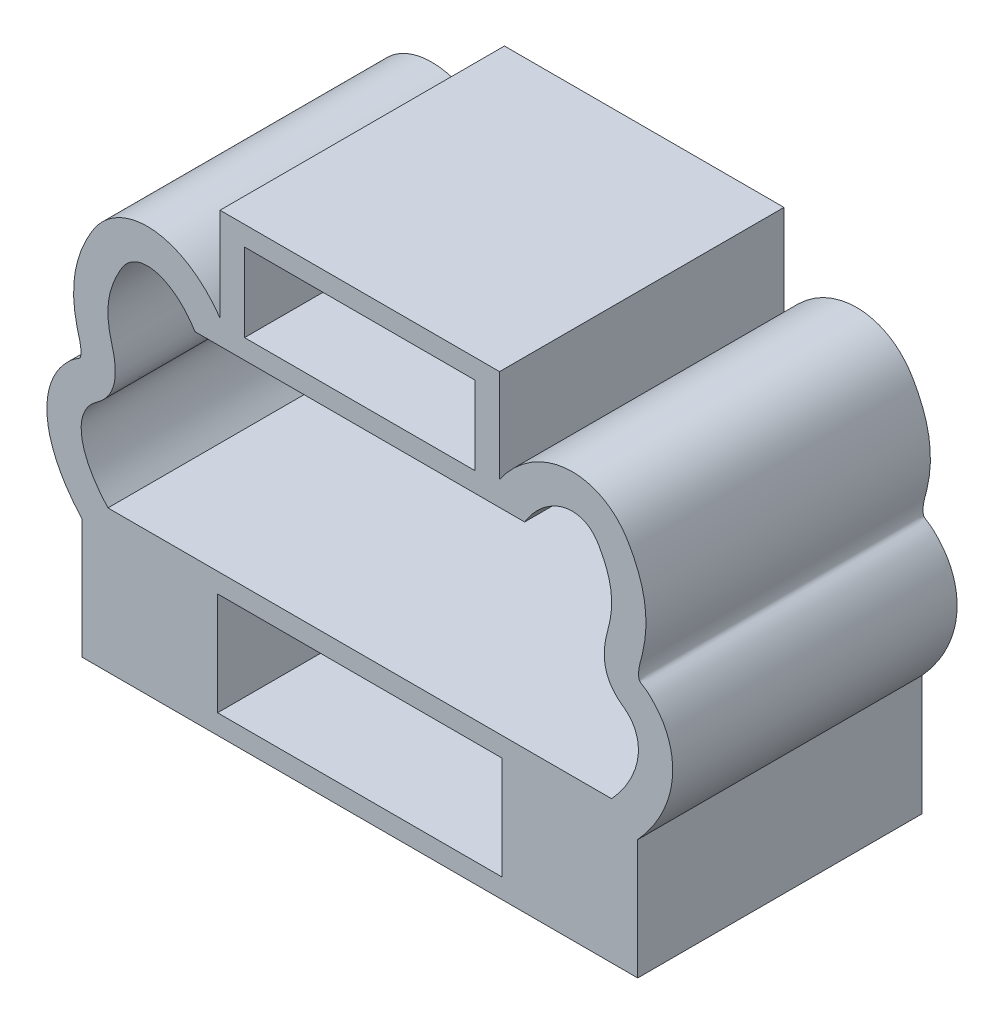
ISO-10303-21;
HEADER;
FILE_DESCRIPTION(('STEP AP214'),'2;1');
FILE_NAME('part.step','',(''),(''),'','','');
FILE_SCHEMA(('AUTOMOTIVE_DESIGN { 1 0 10303 214 1 1 1 1 }'));
ENDSEC;
DATA;
#1=APPLICATION_CONTEXT('core data for automotive mechanical design processes');
#2=APPLICATION_PROTOCOL_DEFINITION('international standard','automotive_design',2000,#1);
#3=PRODUCT_CONTEXT('',#1,'mechanical');
#4=PRODUCT('Part','Part','',(#3));
#5=PRODUCT_RELATED_PRODUCT_CATEGORY('part','',(#4));
#6=PRODUCT_DEFINITION_FORMATION('','',#4);
#7=PRODUCT_DEFINITION_CONTEXT('part definition',#1,'design');
#8=PRODUCT_DEFINITION('design','',#6,#7);
#9=PRODUCT_DEFINITION_SHAPE('','',#8);
#10=(LENGTH_UNIT() NAMED_UNIT(*) SI_UNIT(.MILLI.,.METRE.));
#11=(NAMED_UNIT(*) PLANE_ANGLE_UNIT() SI_UNIT($,.RADIAN.));
#12=(NAMED_UNIT(*) SI_UNIT($,.STERADIAN.) SOLID_ANGLE_UNIT());
#13=UNCERTAINTY_MEASURE_WITH_UNIT(LENGTH_MEASURE(1.E-05),#10,'distance_accuracy_value','');
#14=(GEOMETRIC_REPRESENTATION_CONTEXT(3) GLOBAL_UNCERTAINTY_ASSIGNED_CONTEXT((#13)) GLOBAL_UNIT_ASSIGNED_CONTEXT((#10,
#11,#12)) REPRESENTATION_CONTEXT('',''));
#15=CARTESIAN_POINT('',(0.,0.,0.));
#16=DIRECTION('',(0.,0.,1.));
#17=DIRECTION('',(1.,0.,0.));
#18=AXIS2_PLACEMENT_3D('',#15,#16,#17);
#19=CARTESIAN_POINT('',(0.,0.,5.8));
#20=CARTESIAN_POINT('',(-0.0448449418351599,0.0508124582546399,5.8));
#21=CARTESIAN_POINT('',(-0.0896898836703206,0.101624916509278,5.8));
#22=CARTESIAN_POINT('',(-0.132153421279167,0.154398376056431,5.8));
#23=CARTESIAN_POINT('',(-0.174039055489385,0.206453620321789,5.8));
#24=CARTESIAN_POINT('',(-0.213607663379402,0.26041685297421,5.8));
#25=CARTESIAN_POINT('',(-0.250990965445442,0.315843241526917,5.8));
#26=CARTESIAN_POINT('',(-0.287378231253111,0.369792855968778,5.8));
#27=CARTESIAN_POINT('',(-0.321695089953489,0.425128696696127,5.8));
#28=CARTESIAN_POINT('',(-0.353266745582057,0.482016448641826,5.8));
#29=CARTESIAN_POINT('',(-0.38359362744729,0.536661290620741,5.8));
#30=CARTESIAN_POINT('',(-0.411387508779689,0.592738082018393,5.8));
#31=CARTESIAN_POINT('',(-0.436014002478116,0.650193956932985,5.8));
#32=CARTESIAN_POINT('',(-0.459383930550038,0.704718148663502,5.8));
#33=CARTESIAN_POINT('',(-0.479901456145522,0.760484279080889,5.8));
#34=CARTESIAN_POINT('',(-0.496758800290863,0.817368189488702,5.8));
#35=CARTESIAN_POINT('',(-0.51260297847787,0.870833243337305,5.8));
#36=CARTESIAN_POINT('',(-0.525213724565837,0.925285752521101,5.8));
#37=CARTESIAN_POINT('',(-0.533712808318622,0.980410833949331,5.8));
#38=CARTESIAN_POINT('',(-0.541660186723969,1.03195755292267,5.8));
#39=CARTESIAN_POINT('',(-0.546012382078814,1.08409236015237,5.8));
#40=CARTESIAN_POINT('',(-0.545917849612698,1.1362595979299,5.8));
#41=CARTESIAN_POINT('',(-0.545829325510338,1.18511115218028,5.8));
#42=CARTESIAN_POINT('',(-0.541841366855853,1.23399114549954,5.8));
#43=CARTESIAN_POINT('',(-0.533320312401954,1.2821066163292,5.8));
#44=CARTESIAN_POINT('',(-0.525265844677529,1.32758743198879,5.8));
#45=CARTESIAN_POINT('',(-0.513161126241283,1.37238515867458,5.8));
#46=CARTESIAN_POINT('',(-0.496764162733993,1.41556472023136,5.8));
#47=CARTESIAN_POINT('',(-0.481008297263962,1.45705602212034,5.8));
#48=CARTESIAN_POINT('',(-0.461289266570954,1.49705322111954,5.8));
#49=CARTESIAN_POINT('',(-0.437904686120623,1.53479129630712,5.8));
#50=CARTESIAN_POINT('',(-0.414984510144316,1.57177991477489,5.8));
#51=CARTESIAN_POINT('',(-0.388542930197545,1.6065982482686,5.8));
#52=CARTESIAN_POINT('',(-0.359057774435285,1.63855711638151,5.8));
#53=CARTESIAN_POINT('',(-0.329631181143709,1.6704525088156,5.8));
#54=CARTESIAN_POINT('',(-0.297173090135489,1.69949978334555,5.8));
#55=CARTESIAN_POINT('',(-0.263008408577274,1.72625717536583,5.8));
#56=CARTESIAN_POINT('',(-0.229579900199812,1.7524380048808,5.8));
#57=CARTESIAN_POINT('',(-0.194517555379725,1.77642657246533,5.8));
#58=CARTESIAN_POINT('',(-0.161632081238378,1.80318855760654,5.8));
#59=CARTESIAN_POINT('',(-0.131627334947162,1.8276062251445,5.8));
#60=CARTESIAN_POINT('',(-0.103434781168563,1.85433269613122,5.8));
#61=CARTESIAN_POINT('',(-0.076888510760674,1.88256722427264,5.8));
#62=CARTESIAN_POINT('',(-0.0522827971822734,1.9087377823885,5.8));
#63=CARTESIAN_POINT('',(-0.0290914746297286,1.93620397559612,5.8));
#64=CARTESIAN_POINT('',(-0.0078429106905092,1.96512652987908,5.8));
#65=CARTESIAN_POINT('',(0.0122884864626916,1.99252844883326,5.8));
#66=CARTESIAN_POINT('',(0.0306760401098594,2.02123761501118,5.8));
#67=CARTESIAN_POINT('',(0.0471055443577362,2.05102185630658,5.8));
#68=CARTESIAN_POINT('',(0.0630315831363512,2.07989338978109,5.8));
#69=CARTESIAN_POINT('',(0.0771177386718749,2.10977511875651,5.8));
#70=CARTESIAN_POINT('',(0.0892588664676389,2.14042526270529,5.8));
#71=CARTESIAN_POINT('',(0.101289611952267,2.17079674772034,5.8));
#72=CARTESIAN_POINT('',(0.111410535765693,2.2019227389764,5.8));
#73=CARTESIAN_POINT('',(0.119676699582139,2.23352621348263,5.8));
#74=CARTESIAN_POINT('',(0.128028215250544,2.26545600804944,5.8));
#75=CARTESIAN_POINT('',(0.134486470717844,2.29787319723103,5.8));
#76=CARTESIAN_POINT('',(0.139219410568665,2.33053261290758,5.8));
#77=CARTESIAN_POINT('',(0.144077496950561,2.36405559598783,5.8));
#78=CARTESIAN_POINT('',(0.147117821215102,2.39783378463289,5.8));
#79=CARTESIAN_POINT('',(0.148581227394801,2.43167213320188,5.8));
#80=CARTESIAN_POINT('',(0.150101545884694,2.46682646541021,5.8));
#81=CARTESIAN_POINT('',(0.149919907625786,2.50204572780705,5.8));
#82=CARTESIAN_POINT('',(0.148315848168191,2.53719383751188,5.8));
#83=CARTESIAN_POINT('',(0.146634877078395,2.57402723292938,5.8));
#84=CARTESIAN_POINT('',(0.143391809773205,2.61078248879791,5.8));
#85=CARTESIAN_POINT('',(0.13885626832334,2.64737011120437,5.8));
#86=CARTESIAN_POINT('',(0.134074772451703,2.68594181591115,5.8));
#87=CARTESIAN_POINT('',(0.127856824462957,2.72432721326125,5.8));
#88=CARTESIAN_POINT('',(0.120530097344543,2.76249892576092,5.8));
#89=CARTESIAN_POINT('',(0.112775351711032,2.80290058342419,5.8));
#90=CARTESIAN_POINT('',(0.103778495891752,2.84306286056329,5.8));
#91=CARTESIAN_POINT('',(0.0935712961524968,2.88290647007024,5.8));
#92=CARTESIAN_POINT('',(0.0829075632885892,2.92453214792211,5.8));
#93=CARTESIAN_POINT('',(0.0709227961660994,2.96581001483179,5.8));
#94=CARTESIAN_POINT('',(0.060255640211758,3.00743429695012,5.8));
#95=CARTESIAN_POINT('',(0.0500535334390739,3.04724391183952,5.8));
#96=CARTESIAN_POINT('',(0.041056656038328,3.08737039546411,5.8));
#97=CARTESIAN_POINT('',(0.033219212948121,3.12772077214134,5.8));
#98=CARTESIAN_POINT('',(0.0257628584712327,3.16610914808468,5.8));
#99=CARTESIAN_POINT('',(0.0193559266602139,3.20470017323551,5.8));
#100=CARTESIAN_POINT('',(0.0142149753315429,3.24346370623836,5.8));
#101=CARTESIAN_POINT('',(0.009266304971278,3.28077741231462,5.8));
#102=CARTESIAN_POINT('',(0.0054906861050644,3.31825096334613,5.8));
#103=CARTESIAN_POINT('',(0.0030036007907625,3.35581147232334,5.8));
#104=CARTESIAN_POINT('',(0.0005785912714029,3.39243449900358,5.8));
#105=CARTESIAN_POINT('',(-0.0006214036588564,3.42914019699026,5.8));
#106=CARTESIAN_POINT('',(-0.0005025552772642,3.46584336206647,5.8));
#107=CARTESIAN_POINT('',(-0.0003850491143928,3.50213201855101,5.8));
#108=CARTESIAN_POINT('',(0.0010216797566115,3.53841819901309,5.8));
#109=CARTESIAN_POINT('',(0.0037583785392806,3.57460438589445,5.8));
#110=CARTESIAN_POINT('',(0.0065045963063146,3.61091643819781,5.8));
#111=CARTESIAN_POINT('',(0.0105900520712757,3.64712780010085,5.8));
#112=CARTESIAN_POINT('',(0.0160029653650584,3.6831389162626,5.8));
#113=CARTESIAN_POINT('',(0.0215193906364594,3.71983867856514,5.8));
#114=CARTESIAN_POINT('',(0.0284145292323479,3.75633046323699,5.8));
#115=CARTESIAN_POINT('',(0.0366155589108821,3.79252549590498,5.8));
#116=CARTESIAN_POINT('',(0.0451063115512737,3.82999921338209,5.8));
#117=CARTESIAN_POINT('',(0.0549968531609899,3.86715484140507,5.8));
#118=CARTESIAN_POINT('',(0.0661706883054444,3.90391535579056,5.8));
#119=CARTESIAN_POINT('',(0.0779228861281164,3.94257861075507,5.8));
#120=CARTESIAN_POINT('',(0.0910946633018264,3.98080479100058,5.8));
#121=CARTESIAN_POINT('',(0.105467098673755,4.01857774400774,5.8));
#122=CARTESIAN_POINT('',(0.120818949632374,4.05892475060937,5.8));
#123=CARTESIAN_POINT('',(0.137540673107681,4.09875465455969,5.8));
#124=CARTESIAN_POINT('',(0.155577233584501,4.137956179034,5.8));
#125=CARTESIAN_POINT('',(0.17513469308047,4.18046329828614,5.8));
#126=CARTESIAN_POINT('',(0.196238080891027,4.22223159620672,5.8));
#127=CARTESIAN_POINT('',(0.217918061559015,4.26374143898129,5.8));
#128=CARTESIAN_POINT('',(0.241662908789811,4.30920480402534,5.8));
#129=CARTESIAN_POINT('',(0.266099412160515,4.35435813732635,5.8));
#130=CARTESIAN_POINT('',(0.29465608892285,4.39698002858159,5.8));
#131=CARTESIAN_POINT('',(0.323364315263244,4.43982811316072,5.8));
#132=CARTESIAN_POINT('',(0.356236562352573,4.48011781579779,5.8));
#133=CARTESIAN_POINT('',(0.393739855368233,4.51561917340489,5.8));
#134=CARTESIAN_POINT('',(0.430346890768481,4.55027211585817,5.8));
#135=CARTESIAN_POINT('',(0.471366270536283,4.5803628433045,5.8));
#136=CARTESIAN_POINT('',(0.515612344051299,4.60456631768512,5.8));
#137=CARTESIAN_POINT('',(0.559593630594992,4.62862494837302,5.8));
#138=CARTESIAN_POINT('',(0.606763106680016,4.64686657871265,5.8));
#139=CARTESIAN_POINT('',(0.65543557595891,4.65880940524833,5.8));
#140=CARTESIAN_POINT('',(0.704858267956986,4.6709363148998,5.8));
#141=CARTESIAN_POINT('',(0.755830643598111,4.67656874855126,5.8));
#142=CARTESIAN_POINT('',(0.806705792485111,4.67638524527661,5.8));
#143=CARTESIAN_POINT('',(0.859000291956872,4.6761966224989,5.8));
#144=CARTESIAN_POINT('',(0.911192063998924,4.66986302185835,5.8));
#145=CARTESIAN_POINT('',(0.962228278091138,4.65859686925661,5.8));
#146=CARTESIAN_POINT('',(1.01459481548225,4.64703705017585,5.8));
#147=CARTESIAN_POINT('',(1.06574476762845,4.63028418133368,5.8));
#148=CARTESIAN_POINT('',(1.11517051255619,4.60954149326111,5.8));
#149=CARTESIAN_POINT('',(1.16524397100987,4.58852697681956,5.8));
#150=CARTESIAN_POINT('',(1.2135477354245,4.56341738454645,5.8));
#151=CARTESIAN_POINT('',(1.25989671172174,4.53515962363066,5.8));
#152=CARTESIAN_POINT('',(1.30601279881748,4.5070438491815,5.8));
#153=CARTESIAN_POINT('',(1.35019369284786,4.47581146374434,5.8));
#154=CARTESIAN_POINT('',(1.39241333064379,4.44214210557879,5.8));
#155=CARTESIAN_POINT('',(1.43363020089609,4.40927243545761,5.8));
#156=CARTESIAN_POINT('',(1.47297787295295,4.37408017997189,5.8));
#157=CARTESIAN_POINT('',(1.51042136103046,4.33699160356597,5.8));
#158=CARTESIAN_POINT('',(1.54634374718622,4.30140971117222,5.8));
#159=CARTESIAN_POINT('',(1.58051351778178,4.264082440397,5.8));
#160=CARTESIAN_POINT('',(1.61308752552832,4.22539575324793,5.8));
#161=CARTESIAN_POINT('',(1.64388004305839,4.18882486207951,5.8));
#162=CARTESIAN_POINT('',(1.67324657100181,4.15103918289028,5.8));
#163=CARTESIAN_POINT('',(1.70068073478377,4.11192736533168,5.8));
#164=CARTESIAN_POINT('',(1.72630925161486,4.07538978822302,5.8));
#165=CARTESIAN_POINT('',(1.75025140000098,4.03769489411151,5.8));
#166=CARTESIAN_POINT('',(1.7741935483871,4.,5.8));
#167=B_SPLINE_CURVE_WITH_KNOTS('',3,(#19,#20,#21,#22,#23,#24,#25,#26,#27,#28,#29,#30,#31,#32,
#33,#34,#35,#36,#37,#38,#39,#40,#41,#42,#43,#44,#45,#46,#47,#48,#49,#50,#51,#52,#53,#54,#55,#56,
#57,#58,#59,#60,#61,#62,#63,#64,#65,#66,#67,#68,#69,#70,#71,#72,#73,#74,#75,#76,#77,#78,#79,#80,
#81,#82,#83,#84,#85,#86,#87,#88,#89,#90,#91,#92,#93,#94,#95,#96,#97,#98,#99,#100,#101,#102,#103,
#104,#105,#106,#107,#108,#109,#110,#111,#112,#113,#114,#115,#116,#117,#118,#119,#120,#121,#122,
#123,#124,#125,#126,#127,#128,#129,#130,#131,#132,#133,#134,#135,#136,#137,#138,#139,#140,#141,
#142,#143,#144,#145,#146,#147,#148,#149,#150,#151,#152,#153,#154,#155,#156,#157,#158,#159,#160,
#161,#162,#163,#164,#165,#166),.UNSPECIFIED.,.F.,.F.,(4,3,3,3,3,3,3,3,3,3,3,3,3,3,3,3,3,3,3,3,3,
3,3,3,3,3,3,3,3,3,3,3,3,3,3,3,3,3,3,3,3,3,3,3,3,3,3,3,3,4),(0.,0.20323234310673,0.4036988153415,
0.59882408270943,0.78625615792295,0.96412452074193,1.13130257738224,1.28762851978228,
1.43401858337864,1.57239277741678,1.70535673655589,1.83568010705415,1.96574463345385,
2.0930065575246,2.20912049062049,2.31674638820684,2.41871373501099,2.51755639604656,
2.61550041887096,2.71445575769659,2.81602763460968,2.92154967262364,3.03213129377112,
3.14870956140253,3.2720981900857,3.40100557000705,3.52429305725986,3.64158580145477,
3.75449158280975,3.86457932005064,3.97342377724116,4.08264682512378,4.19395856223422,
4.30920267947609,4.43041188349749,4.55988093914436,4.70026722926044,4.85402433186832,
5.00859741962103,5.15947650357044,5.30945266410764,5.46174051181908,5.61827699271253,
5.77889379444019,5.94161544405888,6.10351946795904,6.26157807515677,6.41321571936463,
6.55656021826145,6.6904701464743),.UNSPECIFIED.);
#168=DIRECTION('',(0.,0.,-1.));
#169=VECTOR('',#168,1.);
#170=SURFACE_OF_LINEAR_EXTRUSION('',#167,#169);
#171=CARTESIAN_POINT('',(0.,0.,0.));
#172=CARTESIAN_POINT('',(-0.0448449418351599,0.0508124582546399,0.));
#173=CARTESIAN_POINT('',(-0.0896898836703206,0.101624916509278,0.));
#174=CARTESIAN_POINT('',(-0.132153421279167,0.154398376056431,0.));
#175=CARTESIAN_POINT('',(-0.174039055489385,0.206453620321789,0.));
#176=CARTESIAN_POINT('',(-0.213607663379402,0.26041685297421,0.));
#177=CARTESIAN_POINT('',(-0.250990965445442,0.315843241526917,0.));
#178=CARTESIAN_POINT('',(-0.287378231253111,0.369792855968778,0.));
#179=CARTESIAN_POINT('',(-0.321695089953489,0.425128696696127,0.));
#180=CARTESIAN_POINT('',(-0.353266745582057,0.482016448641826,0.));
#181=CARTESIAN_POINT('',(-0.38359362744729,0.536661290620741,0.));
#182=CARTESIAN_POINT('',(-0.411387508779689,0.592738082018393,0.));
#183=CARTESIAN_POINT('',(-0.436014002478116,0.650193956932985,0.));
#184=CARTESIAN_POINT('',(-0.459383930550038,0.704718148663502,0.));
#185=CARTESIAN_POINT('',(-0.479901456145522,0.760484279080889,0.));
#186=CARTESIAN_POINT('',(-0.496758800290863,0.817368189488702,0.));
#187=CARTESIAN_POINT('',(-0.51260297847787,0.870833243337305,0.));
#188=CARTESIAN_POINT('',(-0.525213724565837,0.925285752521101,0.));
#189=CARTESIAN_POINT('',(-0.533712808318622,0.980410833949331,0.));
#190=CARTESIAN_POINT('',(-0.541660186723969,1.03195755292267,0.));
#191=CARTESIAN_POINT('',(-0.546012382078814,1.08409236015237,0.));
#192=CARTESIAN_POINT('',(-0.545917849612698,1.1362595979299,0.));
#193=CARTESIAN_POINT('',(-0.545829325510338,1.18511115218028,0.));
#194=CARTESIAN_POINT('',(-0.541841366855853,1.23399114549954,0.));
#195=CARTESIAN_POINT('',(-0.533320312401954,1.2821066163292,0.));
#196=CARTESIAN_POINT('',(-0.525265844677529,1.32758743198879,0.));
#197=CARTESIAN_POINT('',(-0.513161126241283,1.37238515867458,0.));
#198=CARTESIAN_POINT('',(-0.496764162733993,1.41556472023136,0.));
#199=CARTESIAN_POINT('',(-0.481008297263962,1.45705602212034,0.));
#200=CARTESIAN_POINT('',(-0.461289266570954,1.49705322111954,0.));
#201=CARTESIAN_POINT('',(-0.437904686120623,1.53479129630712,0.));
#202=CARTESIAN_POINT('',(-0.414984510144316,1.57177991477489,0.));
#203=CARTESIAN_POINT('',(-0.388542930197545,1.6065982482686,0.));
#204=CARTESIAN_POINT('',(-0.359057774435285,1.63855711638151,0.));
#205=CARTESIAN_POINT('',(-0.329631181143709,1.6704525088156,0.));
#206=CARTESIAN_POINT('',(-0.297173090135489,1.69949978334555,0.));
#207=CARTESIAN_POINT('',(-0.263008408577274,1.72625717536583,0.));
#208=CARTESIAN_POINT('',(-0.229579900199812,1.7524380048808,0.));
#209=CARTESIAN_POINT('',(-0.194517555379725,1.77642657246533,0.));
#210=CARTESIAN_POINT('',(-0.161632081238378,1.80318855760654,0.));
#211=CARTESIAN_POINT('',(-0.131627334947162,1.8276062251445,0.));
#212=CARTESIAN_POINT('',(-0.103434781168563,1.85433269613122,0.));
#213=CARTESIAN_POINT('',(-0.076888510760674,1.88256722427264,0.));
#214=CARTESIAN_POINT('',(-0.0522827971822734,1.9087377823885,0.));
#215=CARTESIAN_POINT('',(-0.0290914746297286,1.93620397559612,0.));
#216=CARTESIAN_POINT('',(-0.0078429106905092,1.96512652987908,0.));
#217=CARTESIAN_POINT('',(0.0122884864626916,1.99252844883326,0.));
#218=CARTESIAN_POINT('',(0.0306760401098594,2.02123761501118,0.));
#219=CARTESIAN_POINT('',(0.0471055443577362,2.05102185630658,0.));
#220=CARTESIAN_POINT('',(0.0630315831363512,2.07989338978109,0.));
#221=CARTESIAN_POINT('',(0.0771177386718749,2.10977511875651,0.));
#222=CARTESIAN_POINT('',(0.0892588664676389,2.14042526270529,0.));
#223=CARTESIAN_POINT('',(0.101289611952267,2.17079674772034,0.));
#224=CARTESIAN_POINT('',(0.111410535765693,2.2019227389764,0.));
#225=CARTESIAN_POINT('',(0.119676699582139,2.23352621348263,0.));
#226=CARTESIAN_POINT('',(0.128028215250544,2.26545600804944,0.));
#227=CARTESIAN_POINT('',(0.134486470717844,2.29787319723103,0.));
#228=CARTESIAN_POINT('',(0.139219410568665,2.33053261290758,0.));
#229=CARTESIAN_POINT('',(0.144077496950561,2.36405559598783,0.));
#230=CARTESIAN_POINT('',(0.147117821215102,2.39783378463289,0.));
#231=CARTESIAN_POINT('',(0.148581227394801,2.43167213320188,0.));
#232=CARTESIAN_POINT('',(0.150101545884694,2.46682646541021,0.));
#233=CARTESIAN_POINT('',(0.149919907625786,2.50204572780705,0.));
#234=CARTESIAN_POINT('',(0.148315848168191,2.53719383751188,0.));
#235=CARTESIAN_POINT('',(0.146634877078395,2.57402723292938,0.));
#236=CARTESIAN_POINT('',(0.143391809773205,2.61078248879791,0.));
#237=CARTESIAN_POINT('',(0.13885626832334,2.64737011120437,0.));
#238=CARTESIAN_POINT('',(0.134074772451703,2.68594181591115,0.));
#239=CARTESIAN_POINT('',(0.127856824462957,2.72432721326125,0.));
#240=CARTESIAN_POINT('',(0.120530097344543,2.76249892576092,0.));
#241=CARTESIAN_POINT('',(0.112775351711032,2.80290058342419,0.));
#242=CARTESIAN_POINT('',(0.103778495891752,2.84306286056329,0.));
#243=CARTESIAN_POINT('',(0.0935712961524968,2.88290647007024,0.));
#244=CARTESIAN_POINT('',(0.0829075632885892,2.92453214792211,0.));
#245=CARTESIAN_POINT('',(0.0709227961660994,2.96581001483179,0.));
#246=CARTESIAN_POINT('',(0.060255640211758,3.00743429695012,0.));
#247=CARTESIAN_POINT('',(0.0500535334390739,3.04724391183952,0.));
#248=CARTESIAN_POINT('',(0.041056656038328,3.08737039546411,0.));
#249=CARTESIAN_POINT('',(0.033219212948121,3.12772077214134,0.));
#250=CARTESIAN_POINT('',(0.0257628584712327,3.16610914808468,0.));
#251=CARTESIAN_POINT('',(0.0193559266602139,3.20470017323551,0.));
#252=CARTESIAN_POINT('',(0.0142149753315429,3.24346370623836,0.));
#253=CARTESIAN_POINT('',(0.009266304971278,3.28077741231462,0.));
#254=CARTESIAN_POINT('',(0.0054906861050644,3.31825096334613,0.));
#255=CARTESIAN_POINT('',(0.0030036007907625,3.35581147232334,0.));
#256=CARTESIAN_POINT('',(0.0005785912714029,3.39243449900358,0.));
#257=CARTESIAN_POINT('',(-0.0006214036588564,3.42914019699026,0.));
#258=CARTESIAN_POINT('',(-0.0005025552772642,3.46584336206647,0.));
#259=CARTESIAN_POINT('',(-0.0003850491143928,3.50213201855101,0.));
#260=CARTESIAN_POINT('',(0.0010216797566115,3.53841819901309,0.));
#261=CARTESIAN_POINT('',(0.0037583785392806,3.57460438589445,0.));
#262=CARTESIAN_POINT('',(0.0065045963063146,3.61091643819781,0.));
#263=CARTESIAN_POINT('',(0.0105900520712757,3.64712780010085,0.));
#264=CARTESIAN_POINT('',(0.0160029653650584,3.6831389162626,0.));
#265=CARTESIAN_POINT('',(0.0215193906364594,3.71983867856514,0.));
#266=CARTESIAN_POINT('',(0.0284145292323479,3.75633046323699,0.));
#267=CARTESIAN_POINT('',(0.0366155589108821,3.79252549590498,0.));
#268=CARTESIAN_POINT('',(0.0451063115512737,3.82999921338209,0.));
#269=CARTESIAN_POINT('',(0.0549968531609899,3.86715484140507,0.));
#270=CARTESIAN_POINT('',(0.0661706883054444,3.90391535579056,0.));
#271=CARTESIAN_POINT('',(0.0779228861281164,3.94257861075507,0.));
#272=CARTESIAN_POINT('',(0.0910946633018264,3.98080479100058,0.));
#273=CARTESIAN_POINT('',(0.105467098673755,4.01857774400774,0.));
#274=CARTESIAN_POINT('',(0.120818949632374,4.05892475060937,0.));
#275=CARTESIAN_POINT('',(0.137540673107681,4.09875465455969,0.));
#276=CARTESIAN_POINT('',(0.155577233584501,4.137956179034,0.));
#277=CARTESIAN_POINT('',(0.17513469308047,4.18046329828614,0.));
#278=CARTESIAN_POINT('',(0.196238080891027,4.22223159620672,0.));
#279=CARTESIAN_POINT('',(0.217918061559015,4.26374143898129,0.));
#280=CARTESIAN_POINT('',(0.241662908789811,4.30920480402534,0.));
#281=CARTESIAN_POINT('',(0.266099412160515,4.35435813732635,0.));
#282=CARTESIAN_POINT('',(0.29465608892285,4.39698002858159,0.));
#283=CARTESIAN_POINT('',(0.323364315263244,4.43982811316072,0.));
#284=CARTESIAN_POINT('',(0.356236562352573,4.48011781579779,0.));
#285=CARTESIAN_POINT('',(0.393739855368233,4.51561917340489,0.));
#286=CARTESIAN_POINT('',(0.430346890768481,4.55027211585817,0.));
#287=CARTESIAN_POINT('',(0.471366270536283,4.5803628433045,0.));
#288=CARTESIAN_POINT('',(0.515612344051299,4.60456631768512,0.));
#289=CARTESIAN_POINT('',(0.559593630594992,4.62862494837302,0.));
#290=CARTESIAN_POINT('',(0.606763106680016,4.64686657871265,0.));
#291=CARTESIAN_POINT('',(0.65543557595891,4.65880940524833,0.));
#292=CARTESIAN_POINT('',(0.704858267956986,4.6709363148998,0.));
#293=CARTESIAN_POINT('',(0.755830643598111,4.67656874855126,0.));
#294=CARTESIAN_POINT('',(0.806705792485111,4.67638524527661,0.));
#295=CARTESIAN_POINT('',(0.859000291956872,4.6761966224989,0.));
#296=CARTESIAN_POINT('',(0.911192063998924,4.66986302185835,0.));
#297=CARTESIAN_POINT('',(0.962228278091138,4.65859686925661,0.));
#298=CARTESIAN_POINT('',(1.01459481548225,4.64703705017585,0.));
#299=CARTESIAN_POINT('',(1.06574476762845,4.63028418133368,0.));
#300=CARTESIAN_POINT('',(1.11517051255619,4.60954149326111,0.));
#301=CARTESIAN_POINT('',(1.16524397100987,4.58852697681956,0.));
#302=CARTESIAN_POINT('',(1.2135477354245,4.56341738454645,0.));
#303=CARTESIAN_POINT('',(1.25989671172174,4.53515962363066,0.));
#304=CARTESIAN_POINT('',(1.30601279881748,4.5070438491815,0.));
#305=CARTESIAN_POINT('',(1.35019369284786,4.47581146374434,0.));
#306=CARTESIAN_POINT('',(1.39241333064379,4.44214210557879,0.));
#307=CARTESIAN_POINT('',(1.43363020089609,4.40927243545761,0.));
#308=CARTESIAN_POINT('',(1.47297787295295,4.37408017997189,0.));
#309=CARTESIAN_POINT('',(1.51042136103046,4.33699160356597,0.));
#310=CARTESIAN_POINT('',(1.54634374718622,4.30140971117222,0.));
#311=CARTESIAN_POINT('',(1.58051351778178,4.264082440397,0.));
#312=CARTESIAN_POINT('',(1.61308752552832,4.22539575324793,0.));
#313=CARTESIAN_POINT('',(1.64388004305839,4.18882486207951,0.));
#314=CARTESIAN_POINT('',(1.67324657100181,4.15103918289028,0.));
#315=CARTESIAN_POINT('',(1.70068073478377,4.11192736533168,0.));
#316=CARTESIAN_POINT('',(1.72630925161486,4.07538978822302,0.));
#317=CARTESIAN_POINT('',(1.75025140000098,4.03769489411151,0.));
#318=CARTESIAN_POINT('',(1.7741935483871,4.,0.));
#319=B_SPLINE_CURVE_WITH_KNOTS('',3,(#171,#172,#173,#174,#175,#176,#177,#178,#179,#180,#181,
#182,#183,#184,#185,#186,#187,#188,#189,#190,#191,#192,#193,#194,#195,#196,#197,#198,#199,#200,
#201,#202,#203,#204,#205,#206,#207,#208,#209,#210,#211,#212,#213,#214,#215,#216,#217,#218,#219,
#220,#221,#222,#223,#224,#225,#226,#227,#228,#229,#230,#231,#232,#233,#234,#235,#236,#237,#238,
#239,#240,#241,#242,#243,#244,#245,#246,#247,#248,#249,#250,#251,#252,#253,#254,#255,#256,#257,
#258,#259,#260,#261,#262,#263,#264,#265,#266,#267,#268,#269,#270,#271,#272,#273,#274,#275,#276,
#277,#278,#279,#280,#281,#282,#283,#284,#285,#286,#287,#288,#289,#290,#291,#292,#293,#294,#295,
#296,#297,#298,#299,#300,#301,#302,#303,#304,#305,#306,#307,#308,#309,#310,#311,#312,#313,#314,
#315,#316,#317,#318),.UNSPECIFIED.,.F.,.F.,(4,3,3,3,3,3,3,3,3,3,3,3,3,3,3,3,3,3,3,3,3,3,3,3,3,3,
3,3,3,3,3,3,3,3,3,3,3,3,3,3,3,3,3,3,3,3,3,3,3,4),(0.,0.20323234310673,0.4036988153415,
0.59882408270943,0.78625615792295,0.96412452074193,1.13130257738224,1.28762851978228,
1.43401858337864,1.57239277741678,1.70535673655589,1.83568010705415,1.96574463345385,
2.0930065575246,2.20912049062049,2.31674638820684,2.41871373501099,2.51755639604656,
2.61550041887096,2.71445575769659,2.81602763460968,2.92154967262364,3.03213129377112,
3.14870956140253,3.2720981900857,3.40100557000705,3.52429305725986,3.64158580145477,
3.75449158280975,3.86457932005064,3.97342377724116,4.08264682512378,4.19395856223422,
4.30920267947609,4.43041188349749,4.55988093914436,4.70026722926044,4.85402433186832,
5.00859741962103,5.15947650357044,5.30945266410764,5.46174051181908,5.61827699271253,
5.77889379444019,5.94161544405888,6.10351946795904,6.26157807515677,6.41321571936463,
6.55656021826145,6.6904701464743),.UNSPECIFIED.);
#320=CARTESIAN_POINT('',(0.,0.,0.));
#321=VERTEX_POINT('',#320);
#322=CARTESIAN_POINT('',(1.7741935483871,4.,0.));
#323=VERTEX_POINT('',#322);
#324=EDGE_CURVE('E161',#321,#323,#319,.T.);
#325=ORIENTED_EDGE('',*,*,#324,.T.);
#326=DIRECTION('',(0.,0.,-1.));
#327=VECTOR('',#326,1.);
#328=CARTESIAN_POINT('',(1.7741935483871,4.,5.8));
#329=LINE('',#328,#327);
#330=CARTESIAN_POINT('',(1.7741935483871,4.,5.8));
#331=VERTEX_POINT('',#330);
#332=EDGE_CURVE('E11',#331,#323,#329,.T.);
#333=ORIENTED_EDGE('',*,*,#332,.F.);
#334=CARTESIAN_POINT('',(0.,0.,5.8));
#335=VERTEX_POINT('',#334);
#336=EDGE_CURVE('E202',#335,#331,#167,.T.);
#337=ORIENTED_EDGE('',*,*,#336,.F.);
#338=DIRECTION('',(0.,0.,-1.));
#339=VECTOR('',#338,1.);
#340=CARTESIAN_POINT('',(0.,0.,5.8));
#341=LINE('',#340,#339);
#342=EDGE_CURVE('E160',#335,#321,#341,.T.);
#343=ORIENTED_EDGE('',*,*,#342,.T.);
#344=EDGE_LOOP('',(#325,#333,#337,#343));
#345=FACE_BOUND('',#344,.T.);
#346=ADVANCED_FACE('F36',(#345),#170,.F.);
#347=CARTESIAN_POINT('',(1.7741935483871,4.,5.8));
#348=DIRECTION('',(0.,1.,0.));
#349=DIRECTION('',(-1.,0.,0.));
#350=AXIS2_PLACEMENT_3D('',#347,#348,#349);
#351=PLANE('',#350);
#352=DIRECTION('',(1.,0.,0.));
#353=VECTOR('',#352,1.);
#354=CARTESIAN_POINT('',(1.7741935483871,4.,0.));
#355=LINE('',#354,#353);
#356=CARTESIAN_POINT('',(8.49734487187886,4.,0.));
#357=VERTEX_POINT('',#356);
#358=EDGE_CURVE('E166',#323,#357,#355,.T.);
#359=ORIENTED_EDGE('',*,*,#358,.T.);
#360=DIRECTION('',(0.,0.,-1.));
#361=VECTOR('',#360,1.);
#362=CARTESIAN_POINT('',(8.49734487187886,4.,5.8));
#363=LINE('',#362,#361);
#364=CARTESIAN_POINT('',(8.49734487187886,4.,5.8));
#365=VERTEX_POINT('',#364);
#366=EDGE_CURVE('E259',#365,#357,#363,.T.);
#367=ORIENTED_EDGE('',*,*,#366,.F.);
#368=DIRECTION('',(1.,0.,0.));
#369=VECTOR('',#368,1.);
#370=CARTESIAN_POINT('',(1.7741935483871,4.,5.8));
#371=LINE('',#370,#369);
#372=EDGE_CURVE('E105',#331,#365,#371,.T.);
#373=ORIENTED_EDGE('',*,*,#372,.F.);
#374=ORIENTED_EDGE('',*,*,#332,.T.);
#375=EDGE_LOOP('',(#359,#367,#373,#374));
#376=FACE_BOUND('',#375,.T.);
#377=ADVANCED_FACE('F325',(#376),#351,.F.);
#378=CARTESIAN_POINT('',(5.13576921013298,4.4,5.8));
#379=DIRECTION('',(0.,-1.,0.));
#380=DIRECTION('',(0.,0.,-1.));
#381=AXIS2_PLACEMENT_3D('',#378,#379,#380);
#382=PLANE('',#381);
#383=DIRECTION('',(-1.,0.,0.));
#384=VECTOR('',#383,1.);
#385=CARTESIAN_POINT('',(5.13576921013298,4.4,0.));
#386=LINE('',#385,#384);
#387=CARTESIAN_POINT('',(7.48576921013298,4.4,0.));
#388=VERTEX_POINT('',#387);
#389=CARTESIAN_POINT('',(2.78576921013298,4.4,0.));
#390=VERTEX_POINT('',#389);
#391=EDGE_CURVE('E173',#388,#390,#386,.T.);
#392=ORIENTED_EDGE('',*,*,#391,.T.);
#393=DIRECTION('',(0.,0.,-1.));
#394=VECTOR('',#393,1.);
#395=CARTESIAN_POINT('',(2.78576921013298,4.4,5.8));
#396=LINE('',#395,#394);
#397=CARTESIAN_POINT('',(2.78576921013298,4.4,5.8));
#398=VERTEX_POINT('',#397);
#399=EDGE_CURVE('E45',#398,#390,#396,.T.);
#400=ORIENTED_EDGE('',*,*,#399,.F.);
#401=DIRECTION('',(-1.,0.,0.));
#402=VECTOR('',#401,1.);
#403=CARTESIAN_POINT('',(5.13576921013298,4.4,5.8));
#404=LINE('',#403,#402);
#405=CARTESIAN_POINT('',(7.48576921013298,4.4,5.8));
#406=VERTEX_POINT('',#405);
#407=EDGE_CURVE('E284',#406,#398,#404,.T.);
#408=ORIENTED_EDGE('',*,*,#407,.F.);
#409=DIRECTION('',(0.,0.,-1.));
#410=VECTOR('',#409,1.);
#411=CARTESIAN_POINT('',(7.48576921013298,4.4,5.8));
#412=LINE('',#411,#410);
#413=EDGE_CURVE('E254',#406,#388,#412,.T.);
#414=ORIENTED_EDGE('',*,*,#413,.T.);
#415=EDGE_LOOP('',(#392,#400,#408,#414));
#416=FACE_BOUND('',#415,.T.);
#417=ADVANCED_FACE('F323',(#416),#382,.F.);
#418=CARTESIAN_POINT('',(2.78576921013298,4.4,5.8));
#419=DIRECTION('',(-1.,0.,0.));
#420=DIRECTION('',(0.,0.,1.));
#421=AXIS2_PLACEMENT_3D('',#418,#419,#420);
#422=PLANE('',#421);
#423=DIRECTION('',(0.,1.,0.));
#424=VECTOR('',#423,1.);
#425=CARTESIAN_POINT('',(2.78576921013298,4.4,0.));
#426=LINE('',#425,#424);
#427=CARTESIAN_POINT('',(2.78576921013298,6.,0.));
#428=VERTEX_POINT('',#427);
#429=EDGE_CURVE('E175',#390,#428,#426,.T.);
#430=ORIENTED_EDGE('',*,*,#429,.T.);
#431=DIRECTION('',(0.,0.,-1.));
#432=VECTOR('',#431,1.);
#433=CARTESIAN_POINT('',(2.78576921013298,6.,5.8));
#434=LINE('',#433,#432);
#435=CARTESIAN_POINT('',(2.78576921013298,6.,5.8));
#436=VERTEX_POINT('',#435);
#437=EDGE_CURVE('E216',#436,#428,#434,.T.);
#438=ORIENTED_EDGE('',*,*,#437,.F.);
#439=DIRECTION('',(0.,1.,0.));
#440=VECTOR('',#439,1.);
#441=CARTESIAN_POINT('',(2.78576921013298,4.4,5.8));
#442=LINE('',#441,#440);
#443=EDGE_CURVE('E225',#398,#436,#442,.T.);
#444=ORIENTED_EDGE('',*,*,#443,.F.);
#445=ORIENTED_EDGE('',*,*,#399,.T.);
#446=EDGE_LOOP('',(#430,#438,#444,#445));
#447=FACE_BOUND('',#446,.T.);
#448=ADVANCED_FACE('F223',(#447),#422,.F.);
#449=CARTESIAN_POINT('',(2.78576921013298,6.,5.8));
#450=DIRECTION('',(0.,1.,0.));
#451=DIRECTION('',(0.,0.,1.));
#452=AXIS2_PLACEMENT_3D('',#449,#450,#451);
#453=PLANE('',#452);
#454=DIRECTION('',(1.,0.,0.));
#455=VECTOR('',#454,1.);
#456=CARTESIAN_POINT('',(2.78576921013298,6.,0.));
#457=LINE('',#456,#455);
#458=CARTESIAN_POINT('',(7.48576921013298,6.,0.));
#459=VERTEX_POINT('',#458);
#460=EDGE_CURVE('E177',#428,#459,#457,.T.);
#461=ORIENTED_EDGE('',*,*,#460,.T.);
#462=DIRECTION('',(0.,0.,-1.));
#463=VECTOR('',#462,1.);
#464=CARTESIAN_POINT('',(7.48576921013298,6.,5.8));
#465=LINE('',#464,#463);
#466=CARTESIAN_POINT('',(7.48576921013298,6.,5.8));
#467=VERTEX_POINT('',#466);
#468=EDGE_CURVE('E244',#467,#459,#465,.T.);
#469=ORIENTED_EDGE('',*,*,#468,.F.);
#470=DIRECTION('',(1.,0.,0.));
#471=VECTOR('',#470,1.);
#472=CARTESIAN_POINT('',(2.78576921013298,6.,5.8));
#473=LINE('',#472,#471);
#474=EDGE_CURVE('E287',#436,#467,#473,.T.);
#475=ORIENTED_EDGE('',*,*,#474,.F.);
#476=ORIENTED_EDGE('',*,*,#437,.T.);
#477=EDGE_LOOP('',(#461,#469,#475,#476));
#478=FACE_BOUND('',#477,.T.);
#479=ADVANCED_FACE('F241',(#478),#453,.F.);
#480=CARTESIAN_POINT('',(5.13576921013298,6.4,5.8));
#481=DIRECTION('',(0.,-1.,0.));
#482=DIRECTION('',(0.,0.,-1.));
#483=AXIS2_PLACEMENT_3D('',#480,#481,#482);
#484=PLANE('',#483);
#485=DIRECTION('',(-1.,0.,0.));
#486=VECTOR('',#485,1.);
#487=CARTESIAN_POINT('',(5.13576921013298,6.4,0.));
#488=LINE('',#487,#486);
#489=CARTESIAN_POINT('',(7.98576921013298,6.4,0.));
#490=VERTEX_POINT('',#489);
#491=CARTESIAN_POINT('',(2.28576921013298,6.4,0.));
#492=VERTEX_POINT('',#491);
#493=EDGE_CURVE('E180',#490,#492,#488,.T.);
#494=ORIENTED_EDGE('',*,*,#493,.T.);
#495=DIRECTION('',(0.,0.,-1.));
#496=VECTOR('',#495,1.);
#497=CARTESIAN_POINT('',(2.28576921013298,6.4,5.8));
#498=LINE('',#497,#496);
#499=CARTESIAN_POINT('',(2.28576921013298,6.4,5.8));
#500=VERTEX_POINT('',#499);
#501=EDGE_CURVE('E213',#500,#492,#498,.T.);
#502=ORIENTED_EDGE('',*,*,#501,.F.);
#503=DIRECTION('',(-1.,0.,0.));
#504=VECTOR('',#503,1.);
#505=CARTESIAN_POINT('',(5.13576921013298,6.4,5.8));
#506=LINE('',#505,#504);
#507=CARTESIAN_POINT('',(7.98576921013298,6.4,5.8));
#508=VERTEX_POINT('',#507);
#509=EDGE_CURVE('E290',#508,#500,#506,.T.);
#510=ORIENTED_EDGE('',*,*,#509,.F.);
#511=DIRECTION('',(0.,0.,-1.));
#512=VECTOR('',#511,1.);
#513=CARTESIAN_POINT('',(7.98576921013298,6.4,5.8));
#514=LINE('',#513,#512);
#515=EDGE_CURVE('E253',#508,#490,#514,.T.);
#516=ORIENTED_EDGE('',*,*,#515,.T.);
#517=EDGE_LOOP('',(#494,#502,#510,#516));
#518=FACE_BOUND('',#517,.T.);
#519=ADVANCED_FACE('F314',(#518),#484,.F.);
#520=CARTESIAN_POINT('',(2.28576921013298,6.4,5.8));
#521=DIRECTION('',(1.,0.,0.));
#522=DIRECTION('',(0.,1.,0.));
#523=AXIS2_PLACEMENT_3D('',#520,#521,#522);
#524=PLANE('',#523);
#525=DIRECTION('',(0.,-1.,0.));
#526=VECTOR('',#525,1.);
#527=CARTESIAN_POINT('',(2.28576921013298,6.4,0.));
#528=LINE('',#527,#526);
#529=CARTESIAN_POINT('',(2.28576921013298,4.49620783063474,0.));
#530=VERTEX_POINT('',#529);
#531=EDGE_CURVE('E182',#492,#530,#528,.T.);
#532=ORIENTED_EDGE('',*,*,#531,.T.);
#533=DIRECTION('',(0.,0.,-1.));
#534=VECTOR('',#533,1.);
#535=CARTESIAN_POINT('',(2.28576921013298,4.49620783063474,5.8));
#536=LINE('',#535,#534);
#537=CARTESIAN_POINT('',(2.28576921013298,4.49620783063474,5.8));
#538=VERTEX_POINT('',#537);
#539=EDGE_CURVE('E210',#538,#530,#536,.T.);
#540=ORIENTED_EDGE('',*,*,#539,.F.);
#541=DIRECTION('',(0.,-1.,0.));
#542=VECTOR('',#541,1.);
#543=CARTESIAN_POINT('',(2.28576921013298,6.4,5.8));
#544=LINE('',#543,#542);
#545=EDGE_CURVE('E292',#500,#538,#544,.T.);
#546=ORIENTED_EDGE('',*,*,#545,.F.);
#547=ORIENTED_EDGE('',*,*,#501,.T.);
#548=EDGE_LOOP('',(#532,#540,#546,#547));
#549=FACE_BOUND('',#548,.T.);
#550=ADVANCED_FACE('F309',(#549),#524,.F.);
#551=CARTESIAN_POINT('',(2.28576921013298,4.49620783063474,5.8));
#552=CARTESIAN_POINT('',(2.24710857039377,4.54920414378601,5.8));
#553=CARTESIAN_POINT('',(2.20844793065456,4.60220045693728,5.8));
#554=CARTESIAN_POINT('',(2.16719230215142,4.65314322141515,5.8));
#555=CARTESIAN_POINT('',(2.12272366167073,4.70805343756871,5.8));
#556=CARTESIAN_POINT('',(2.07524009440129,4.76057778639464,5.8));
#557=CARTESIAN_POINT('',(2.02557771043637,4.81092613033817,5.8));
#558=CARTESIAN_POINT('',(1.97230808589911,4.86493153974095,5.8));
#559=CARTESIAN_POINT('',(1.9165316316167,4.91643335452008,5.8));
#560=CARTESIAN_POINT('',(1.85809724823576,4.96476863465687,5.8));
#561=CARTESIAN_POINT('',(1.79569774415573,5.01638375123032,5.8));
#562=CARTESIAN_POINT('',(1.73026736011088,5.06438801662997,5.8));
#563=CARTESIAN_POINT('',(1.66206252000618,5.10810173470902,5.8));
#564=CARTESIAN_POINT('',(1.58943366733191,5.15465088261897,5.8));
#565=CARTESIAN_POINT('',(1.51365876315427,5.19633483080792,5.8));
#566=CARTESIAN_POINT('',(1.43514827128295,5.23212822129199,5.8));
#567=CARTESIAN_POINT('',(1.35156155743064,5.27023589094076,5.8));
#568=CARTESIAN_POINT('',(1.2648740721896,5.30166665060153,5.8));
#569=CARTESIAN_POINT('',(1.17602137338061,5.3251495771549,5.8));
#570=CARTESIAN_POINT('',(1.08129785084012,5.35018410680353,5.8));
#571=CARTESIAN_POINT('',(0.984113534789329,5.36618582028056,5.8));
#572=CARTESIAN_POINT('',(0.886251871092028,5.37185086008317,5.8));
#573=CARTESIAN_POINT('',(0.782188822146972,5.3778748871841,5.8));
#574=CARTESIAN_POINT('',(0.677359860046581,5.37221068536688,5.8));
#575=CARTESIAN_POINT('',(0.574647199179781,5.35413180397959,5.8));
#576=CARTESIAN_POINT('',(0.46706101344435,5.33519511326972,5.8));
#577=CARTESIAN_POINT('',(0.361796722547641,5.30263768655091,5.8));
#578=CARTESIAN_POINT('',(0.262437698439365,5.25717845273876,5.8));
#579=CARTESIAN_POINT('',(0.161549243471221,5.2110194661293,5.8));
#580=CARTESIAN_POINT('',(0.066749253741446,5.15155842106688,5.8));
#581=CARTESIAN_POINT('',(-0.0189283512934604,5.08104374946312,5.8));
#582=CARTESIAN_POINT('',(-0.10273324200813,5.01207036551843,5.8));
#583=CARTESIAN_POINT('',(-0.177810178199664,4.9325212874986,5.8));
#584=CARTESIAN_POINT('',(-0.24261338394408,4.84569097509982,5.8));
#585=CARTESIAN_POINT('',(-0.297427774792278,4.77224475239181,5.8));
#586=CARTESIAN_POINT('',(-0.344891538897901,4.69358896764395,5.8));
#587=CARTESIAN_POINT('',(-0.388668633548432,4.61310168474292,5.8));
#588=CARTESIAN_POINT('',(-0.418005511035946,4.55916376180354,5.8));
#589=CARTESIAN_POINT('',(-0.445686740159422,4.50440333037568,5.8));
#590=CARTESIAN_POINT('',(-0.471618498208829,4.4488026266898,5.8));
#591=CARTESIAN_POINT('',(-0.496041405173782,4.39643707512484,5.8));
#592=CARTESIAN_POINT('',(-0.518912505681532,4.34332618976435,5.8));
#593=CARTESIAN_POINT('',(-0.539975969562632,4.28950807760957,5.8));
#594=CARTESIAN_POINT('',(-0.560421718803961,4.23726825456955,5.8));
#595=CARTESIAN_POINT('',(-0.579164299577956,4.18436207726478,5.8));
#596=CARTESIAN_POINT('',(-0.596020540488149,4.13085758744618,5.8));
#597=CARTESIAN_POINT('',(-0.612528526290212,4.07845851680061,5.8));
#598=CARTESIAN_POINT('',(-0.627227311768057,4.02548560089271,5.8));
#599=CARTESIAN_POINT('',(-0.639973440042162,3.97204520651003,5.8));
#600=CARTESIAN_POINT('',(-0.652538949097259,3.91936209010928,5.8));
#601=CARTESIAN_POINT('',(-0.663206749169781,3.86622465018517,5.8));
#602=CARTESIAN_POINT('',(-0.671890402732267,3.81276419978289,5.8));
#603=CARTESIAN_POINT('',(-0.68049270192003,3.75980460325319,5.8));
#604=CARTESIAN_POINT('',(-0.68714785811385,3.70652802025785,5.8));
#605=CARTESIAN_POINT('',(-0.691828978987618,3.6530787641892,5.8));
#606=CARTESIAN_POINT('',(-0.696484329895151,3.59992375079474,5.8));
#607=CARTESIAN_POINT('',(-0.699187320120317,3.54659796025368,5.8));
#608=CARTESIAN_POINT('',(-0.699965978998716,3.49324626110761,5.8));
#609=CARTESIAN_POINT('',(-0.700743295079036,3.43998656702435,5.8));
#610=CARTESIAN_POINT('',(-0.699602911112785,3.38670105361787,5.8));
#611=CARTESIAN_POINT('',(-0.696641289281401,3.33351735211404,5.8));
#612=CARTESIAN_POINT('',(-0.693671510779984,3.28018717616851,5.8));
#613=CARTESIAN_POINT('',(-0.688870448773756,3.22695937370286,5.8));
#614=CARTESIAN_POINT('',(-0.682325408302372,3.17395475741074,5.8));
#615=CARTESIAN_POINT('',(-0.675724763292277,3.12049983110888,5.8));
#616=CARTESIAN_POINT('',(-0.667350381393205,3.06727189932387,5.8));
#617=CARTESIAN_POINT('',(-0.65753156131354,3.01430398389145,5.8));
#618=CARTESIAN_POINT('',(-0.647557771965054,2.96050008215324,5.8));
#619=CARTESIAN_POINT('',(-0.636093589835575,2.90696446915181,5.8));
#620=CARTESIAN_POINT('',(-0.622705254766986,2.85392724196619,5.8));
#621=CARTESIAN_POINT('',(-0.609887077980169,2.8031486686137,5.8));
#622=CARTESIAN_POINT('',(-0.595305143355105,2.75282693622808,5.8));
#623=CARTESIAN_POINT('',(-0.58264661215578,2.70199394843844,5.8));
#624=CARTESIAN_POINT('',(-0.575025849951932,2.67139117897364,5.8));
#625=CARTESIAN_POINT('',(-0.56810219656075,2.64060311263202,5.8));
#626=CARTESIAN_POINT('',(-0.562557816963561,2.60955808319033,5.8));
#627=CARTESIAN_POINT('',(-0.558282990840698,2.58562175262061,5.8));
#628=CARTESIAN_POINT('',(-0.554828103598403,2.56153266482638,5.8));
#629=CARTESIAN_POINT('',(-0.55244041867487,2.53732970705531,5.8));
#630=CARTESIAN_POINT('',(-0.55047259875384,2.51738274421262,5.8));
#631=CARTESIAN_POINT('',(-0.54922965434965,2.49735843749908,5.8));
#632=CARTESIAN_POINT('',(-0.549118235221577,2.47731312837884,5.8));
#633=CARTESIAN_POINT('',(-0.549030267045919,2.46148685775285,5.8));
#634=CARTESIAN_POINT('',(-0.549647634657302,2.4456474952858,5.8));
#635=CARTESIAN_POINT('',(-0.551416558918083,2.42991169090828,5.8));
#636=CARTESIAN_POINT('',(-0.552737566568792,2.41816041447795,5.8));
#637=CARTESIAN_POINT('',(-0.554700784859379,2.40646689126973,5.8));
#638=CARTESIAN_POINT('',(-0.557800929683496,2.39505117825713,5.8));
#639=CARTESIAN_POINT('',(-0.55997615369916,2.38704131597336,5.8));
#640=CARTESIAN_POINT('',(-0.562711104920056,2.37916822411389,5.8));
#641=CARTESIAN_POINT('',(-0.566536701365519,2.37176936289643,5.8));
#642=CARTESIAN_POINT('',(-0.569141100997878,2.36673234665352,5.8));
#643=CARTESIAN_POINT('',(-0.57225097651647,2.36191511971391,5.8));
#644=CARTESIAN_POINT('',(-0.57612799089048,2.35781967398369,5.8));
#645=CARTESIAN_POINT('',(-0.57908536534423,2.35469568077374,5.8));
#646=CARTESIAN_POINT('',(-0.582489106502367,2.35199166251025,5.8));
#647=CARTESIAN_POINT('',(-0.58604601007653,2.34955009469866,5.8));
#648=CARTESIAN_POINT('',(-0.589775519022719,2.34699004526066,5.8));
#649=CARTESIAN_POINT('',(-0.593673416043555,2.34471853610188,5.8));
#650=CARTESIAN_POINT('',(-0.597509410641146,2.3423445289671,5.8));
#651=CARTESIAN_POINT('',(-0.603044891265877,2.33891874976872,5.8));
#652=CARTESIAN_POINT('',(-0.608451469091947,2.33527953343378,5.8));
#653=CARTESIAN_POINT('',(-0.613855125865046,2.33164055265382,5.8));
#654=CARTESIAN_POINT('',(-0.622606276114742,2.32574727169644,5.8));
#655=CARTESIAN_POINT('',(-0.631349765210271,2.31985460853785,5.8));
#656=CARTESIAN_POINT('',(-0.64017126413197,2.31407039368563,5.8));
#657=CARTESIAN_POINT('',(-0.655510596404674,2.30401246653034,5.8));
#658=CARTESIAN_POINT('',(-0.671085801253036,2.29428244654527,5.8));
#659=CARTESIAN_POINT('',(-0.686166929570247,2.28387430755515,5.8));
#660=CARTESIAN_POINT('',(-0.739227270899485,2.24725507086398,5.8));
#661=CARTESIAN_POINT('',(-0.786171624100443,2.20224165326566,5.8));
#662=CARTESIAN_POINT('',(-0.831054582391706,2.15548942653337,5.8));
#663=CARTESIAN_POINT('',(-0.890549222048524,2.0935169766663,5.8));
#664=CARTESIAN_POINT('',(-0.946421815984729,2.02848929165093,5.8));
#665=CARTESIAN_POINT('',(-0.995257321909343,1.9582981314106,5.8));
#666=CARTESIAN_POINT('',(-1.04593695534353,1.88545641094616,5.8));
#667=CARTESIAN_POINT('',(-1.08903799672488,1.80705388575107,5.8));
#668=CARTESIAN_POINT('',(-1.12444254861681,1.72543540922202,5.8));
#669=CARTESIAN_POINT('',(-1.16056729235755,1.64215666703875,5.8));
#670=CARTESIAN_POINT('',(-1.18867924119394,1.55552980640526,5.8));
#671=CARTESIAN_POINT('',(-1.20845105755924,1.4670349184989,5.8));
#672=CARTESIAN_POINT('',(-1.22830012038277,1.37819429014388,5.8));
#673=CARTESIAN_POINT('',(-1.23974375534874,1.28747100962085,5.8));
#674=CARTESIAN_POINT('',(-1.24332114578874,1.19649781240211,5.8));
#675=CARTESIAN_POINT('',(-1.24687517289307,1.10611874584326,5.8));
#676=CARTESIAN_POINT('',(-1.24266536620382,1.01549301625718,5.8));
#677=CARTESIAN_POINT('',(-1.23157608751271,0.925758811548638,5.8));
#678=CARTESIAN_POINT('',(-1.22059959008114,0.836937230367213,5.8));
#679=CARTESIAN_POINT('',(-1.20288284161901,0.748989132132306,5.8));
#680=CARTESIAN_POINT('',(-1.17944319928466,0.662636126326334,5.8));
#681=CARTESIAN_POINT('',(-1.15623019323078,0.577118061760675,5.8));
#682=CARTESIAN_POINT('',(-1.12740442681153,0.493164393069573,5.8));
#683=CARTESIAN_POINT('',(-1.09392730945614,0.411133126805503,5.8));
#684=CARTESIAN_POINT('',(-1.0607308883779,0.329789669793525,5.8));
#685=CARTESIAN_POINT('',(-1.02296078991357,0.250336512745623,5.8));
#686=CARTESIAN_POINT('',(-0.981356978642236,0.172981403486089,5.8));
#687=CARTESIAN_POINT('',(-0.940106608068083,0.0962834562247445,5.8));
#688=CARTESIAN_POINT('',(-0.89508738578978,0.0216480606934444,5.8));
#689=CARTESIAN_POINT('',(-0.847127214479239,-0.0510648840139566,5.8));
#690=CARTESIAN_POINT('',(-0.799680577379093,-0.12299925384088,5.8));
#691=CARTESIAN_POINT('',(-0.749355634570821,-0.193052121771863,5.8));
#692=CARTESIAN_POINT('',(-0.695895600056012,-0.260565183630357,5.8));
#693=CARTESIAN_POINT('',(-0.643225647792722,-0.327080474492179,5.8));
#694=CARTESIAN_POINT('',(-0.58751258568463,-0.39113047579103,5.8));
#695=CARTESIAN_POINT('',(-0.53179952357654,-0.45518047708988,5.8));
#696=B_SPLINE_CURVE_WITH_KNOTS('',3,(#551,#552,#553,#554,#555,#556,#557,#558,#559,#560,#561,
#562,#563,#564,#565,#566,#567,#568,#569,#570,#571,#572,#573,#574,#575,#576,#577,#578,#579,#580,
#581,#582,#583,#584,#585,#586,#587,#588,#589,#590,#591,#592,#593,#594,#595,#596,#597,#598,#599,
#600,#601,#602,#603,#604,#605,#606,#607,#608,#609,#610,#611,#612,#613,#614,#615,#616,#617,#618,
#619,#620,#621,#622,#623,#624,#625,#626,#627,#628,#629,#630,#631,#632,#633,#634,#635,#636,#637,
#638,#639,#640,#641,#642,#643,#644,#645,#646,#647,#648,#649,#650,#651,#652,#653,#654,#655,#656,
#657,#658,#659,#660,#661,#662,#663,#664,#665,#666,#667,#668,#669,#670,#671,#672,#673,#674,#675,
#676,#677,#678,#679,#680,#681,#682,#683,#684,#685,#686,#687,#688,#689,#690,#691,#692,#693,#694,
#695),.UNSPECIFIED.,.F.,.F.,(4,3,3,3,3,3,3,3,3,3,3,3,3,3,3,3,3,3,3,3,3,3,3,3,3,3,3,3,3,3,3,3,3,
3,3,3,3,3,3,3,3,3,3,3,3,3,3,3,4),(-8.84170284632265,-8.64500714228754,-8.43299266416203,
-8.20557845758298,-7.96273284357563,-7.70413538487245,-7.42881789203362,-7.13530916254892,
-6.82320110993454,-6.4962841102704,-6.16433488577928,-5.83964130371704,-5.56499623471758,
-5.3809449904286,-5.20760285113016,-5.03934420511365,-4.87456183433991,-4.71211451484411,
-4.55118911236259,-4.39114961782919,-4.23138611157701,-4.07118259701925,-3.90961804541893,
-3.74550353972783,-3.58837804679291,-3.49378444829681,-3.42085091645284,-3.36074245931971,
-3.31328533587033,-3.27784502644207,-3.25297824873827,-3.23604937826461,-3.22313608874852,
-3.20959615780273,-3.19005754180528,-3.15841501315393,-3.10339315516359,-2.90980826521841,
-2.65320166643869,-2.38690508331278,-2.11519155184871,-1.84241646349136,-1.57142282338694,
-1.30318526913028,-1.0375412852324,-0.77412465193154,-0.51294584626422,-0.25456361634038,0.),.UNSPECIFIED.);
#697=DIRECTION('',(0.,0.,-1.));
#698=VECTOR('',#697,1.);
#699=SURFACE_OF_LINEAR_EXTRUSION('',#696,#698);
#700=CARTESIAN_POINT('',(2.28576921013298,4.49620783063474,0.));
#701=CARTESIAN_POINT('',(2.24710857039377,4.54920414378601,0.));
#702=CARTESIAN_POINT('',(2.20844793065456,4.60220045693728,0.));
#703=CARTESIAN_POINT('',(2.16719230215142,4.65314322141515,0.));
#704=CARTESIAN_POINT('',(2.12272366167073,4.70805343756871,0.));
#705=CARTESIAN_POINT('',(2.07524009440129,4.76057778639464,0.));
#706=CARTESIAN_POINT('',(2.02557771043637,4.81092613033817,0.));
#707=CARTESIAN_POINT('',(1.97230808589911,4.86493153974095,0.));
#708=CARTESIAN_POINT('',(1.9165316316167,4.91643335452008,0.));
#709=CARTESIAN_POINT('',(1.85809724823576,4.96476863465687,0.));
#710=CARTESIAN_POINT('',(1.79569774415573,5.01638375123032,0.));
#711=CARTESIAN_POINT('',(1.73026736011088,5.06438801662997,0.));
#712=CARTESIAN_POINT('',(1.66206252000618,5.10810173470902,0.));
#713=CARTESIAN_POINT('',(1.58943366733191,5.15465088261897,0.));
#714=CARTESIAN_POINT('',(1.51365876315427,5.19633483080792,0.));
#715=CARTESIAN_POINT('',(1.43514827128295,5.23212822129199,0.));
#716=CARTESIAN_POINT('',(1.35156155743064,5.27023589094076,0.));
#717=CARTESIAN_POINT('',(1.2648740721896,5.30166665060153,0.));
#718=CARTESIAN_POINT('',(1.17602137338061,5.3251495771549,0.));
#719=CARTESIAN_POINT('',(1.08129785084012,5.35018410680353,0.));
#720=CARTESIAN_POINT('',(0.984113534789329,5.36618582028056,0.));
#721=CARTESIAN_POINT('',(0.886251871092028,5.37185086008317,0.));
#722=CARTESIAN_POINT('',(0.782188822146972,5.3778748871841,0.));
#723=CARTESIAN_POINT('',(0.677359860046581,5.37221068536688,0.));
#724=CARTESIAN_POINT('',(0.574647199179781,5.35413180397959,0.));
#725=CARTESIAN_POINT('',(0.46706101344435,5.33519511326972,0.));
#726=CARTESIAN_POINT('',(0.361796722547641,5.30263768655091,0.));
#727=CARTESIAN_POINT('',(0.262437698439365,5.25717845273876,0.));
#728=CARTESIAN_POINT('',(0.161549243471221,5.2110194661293,0.));
#729=CARTESIAN_POINT('',(0.066749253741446,5.15155842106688,0.));
#730=CARTESIAN_POINT('',(-0.0189283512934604,5.08104374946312,0.));
#731=CARTESIAN_POINT('',(-0.10273324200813,5.01207036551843,0.));
#732=CARTESIAN_POINT('',(-0.177810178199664,4.9325212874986,0.));
#733=CARTESIAN_POINT('',(-0.24261338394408,4.84569097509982,0.));
#734=CARTESIAN_POINT('',(-0.297427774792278,4.77224475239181,0.));
#735=CARTESIAN_POINT('',(-0.344891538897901,4.69358896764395,0.));
#736=CARTESIAN_POINT('',(-0.388668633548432,4.61310168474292,0.));
#737=CARTESIAN_POINT('',(-0.418005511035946,4.55916376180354,0.));
#738=CARTESIAN_POINT('',(-0.445686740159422,4.50440333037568,0.));
#739=CARTESIAN_POINT('',(-0.471618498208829,4.4488026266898,0.));
#740=CARTESIAN_POINT('',(-0.496041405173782,4.39643707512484,0.));
#741=CARTESIAN_POINT('',(-0.518912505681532,4.34332618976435,0.));
#742=CARTESIAN_POINT('',(-0.539975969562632,4.28950807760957,0.));
#743=CARTESIAN_POINT('',(-0.560421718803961,4.23726825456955,0.));
#744=CARTESIAN_POINT('',(-0.579164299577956,4.18436207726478,0.));
#745=CARTESIAN_POINT('',(-0.596020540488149,4.13085758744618,0.));
#746=CARTESIAN_POINT('',(-0.612528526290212,4.07845851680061,0.));
#747=CARTESIAN_POINT('',(-0.627227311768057,4.02548560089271,0.));
#748=CARTESIAN_POINT('',(-0.639973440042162,3.97204520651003,0.));
#749=CARTESIAN_POINT('',(-0.652538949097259,3.91936209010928,0.));
#750=CARTESIAN_POINT('',(-0.663206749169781,3.86622465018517,0.));
#751=CARTESIAN_POINT('',(-0.671890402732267,3.81276419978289,0.));
#752=CARTESIAN_POINT('',(-0.68049270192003,3.75980460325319,0.));
#753=CARTESIAN_POINT('',(-0.68714785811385,3.70652802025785,0.));
#754=CARTESIAN_POINT('',(-0.691828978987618,3.6530787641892,0.));
#755=CARTESIAN_POINT('',(-0.696484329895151,3.59992375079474,0.));
#756=CARTESIAN_POINT('',(-0.699187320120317,3.54659796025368,0.));
#757=CARTESIAN_POINT('',(-0.699965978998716,3.49324626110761,0.));
#758=CARTESIAN_POINT('',(-0.700743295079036,3.43998656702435,0.));
#759=CARTESIAN_POINT('',(-0.699602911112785,3.38670105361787,0.));
#760=CARTESIAN_POINT('',(-0.696641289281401,3.33351735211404,0.));
#761=CARTESIAN_POINT('',(-0.693671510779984,3.28018717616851,0.));
#762=CARTESIAN_POINT('',(-0.688870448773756,3.22695937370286,0.));
#763=CARTESIAN_POINT('',(-0.682325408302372,3.17395475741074,0.));
#764=CARTESIAN_POINT('',(-0.675724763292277,3.12049983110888,0.));
#765=CARTESIAN_POINT('',(-0.667350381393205,3.06727189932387,0.));
#766=CARTESIAN_POINT('',(-0.65753156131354,3.01430398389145,0.));
#767=CARTESIAN_POINT('',(-0.647557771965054,2.96050008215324,0.));
#768=CARTESIAN_POINT('',(-0.636093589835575,2.90696446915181,0.));
#769=CARTESIAN_POINT('',(-0.622705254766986,2.85392724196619,0.));
#770=CARTESIAN_POINT('',(-0.609887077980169,2.8031486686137,0.));
#771=CARTESIAN_POINT('',(-0.595305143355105,2.75282693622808,0.));
#772=CARTESIAN_POINT('',(-0.58264661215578,2.70199394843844,0.));
#773=CARTESIAN_POINT('',(-0.575025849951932,2.67139117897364,0.));
#774=CARTESIAN_POINT('',(-0.56810219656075,2.64060311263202,0.));
#775=CARTESIAN_POINT('',(-0.562557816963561,2.60955808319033,0.));
#776=CARTESIAN_POINT('',(-0.558282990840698,2.58562175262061,0.));
#777=CARTESIAN_POINT('',(-0.554828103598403,2.56153266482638,0.));
#778=CARTESIAN_POINT('',(-0.55244041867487,2.53732970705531,0.));
#779=CARTESIAN_POINT('',(-0.55047259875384,2.51738274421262,0.));
#780=CARTESIAN_POINT('',(-0.54922965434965,2.49735843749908,0.));
#781=CARTESIAN_POINT('',(-0.549118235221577,2.47731312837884,0.));
#782=CARTESIAN_POINT('',(-0.549030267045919,2.46148685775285,0.));
#783=CARTESIAN_POINT('',(-0.549647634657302,2.4456474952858,0.));
#784=CARTESIAN_POINT('',(-0.551416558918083,2.42991169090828,0.));
#785=CARTESIAN_POINT('',(-0.552737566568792,2.41816041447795,0.));
#786=CARTESIAN_POINT('',(-0.554700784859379,2.40646689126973,0.));
#787=CARTESIAN_POINT('',(-0.557800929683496,2.39505117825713,0.));
#788=CARTESIAN_POINT('',(-0.55997615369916,2.38704131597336,0.));
#789=CARTESIAN_POINT('',(-0.562711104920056,2.37916822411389,0.));
#790=CARTESIAN_POINT('',(-0.566536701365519,2.37176936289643,0.));
#791=CARTESIAN_POINT('',(-0.569141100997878,2.36673234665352,0.));
#792=CARTESIAN_POINT('',(-0.57225097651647,2.36191511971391,0.));
#793=CARTESIAN_POINT('',(-0.57612799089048,2.35781967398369,0.));
#794=CARTESIAN_POINT('',(-0.57908536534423,2.35469568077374,0.));
#795=CARTESIAN_POINT('',(-0.582489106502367,2.35199166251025,0.));
#796=CARTESIAN_POINT('',(-0.58604601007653,2.34955009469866,0.));
#797=CARTESIAN_POINT('',(-0.589775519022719,2.34699004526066,0.));
#798=CARTESIAN_POINT('',(-0.593673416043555,2.34471853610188,0.));
#799=CARTESIAN_POINT('',(-0.597509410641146,2.3423445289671,0.));
#800=CARTESIAN_POINT('',(-0.603044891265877,2.33891874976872,0.));
#801=CARTESIAN_POINT('',(-0.608451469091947,2.33527953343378,0.));
#802=CARTESIAN_POINT('',(-0.613855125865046,2.33164055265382,0.));
#803=CARTESIAN_POINT('',(-0.622606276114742,2.32574727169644,0.));
#804=CARTESIAN_POINT('',(-0.631349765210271,2.31985460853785,0.));
#805=CARTESIAN_POINT('',(-0.64017126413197,2.31407039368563,0.));
#806=CARTESIAN_POINT('',(-0.655510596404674,2.30401246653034,0.));
#807=CARTESIAN_POINT('',(-0.671085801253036,2.29428244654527,0.));
#808=CARTESIAN_POINT('',(-0.686166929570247,2.28387430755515,0.));
#809=CARTESIAN_POINT('',(-0.739227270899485,2.24725507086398,0.));
#810=CARTESIAN_POINT('',(-0.786171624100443,2.20224165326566,0.));
#811=CARTESIAN_POINT('',(-0.831054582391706,2.15548942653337,0.));
#812=CARTESIAN_POINT('',(-0.890549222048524,2.0935169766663,0.));
#813=CARTESIAN_POINT('',(-0.946421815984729,2.02848929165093,0.));
#814=CARTESIAN_POINT('',(-0.995257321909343,1.9582981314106,0.));
#815=CARTESIAN_POINT('',(-1.04593695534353,1.88545641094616,0.));
#816=CARTESIAN_POINT('',(-1.08903799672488,1.80705388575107,0.));
#817=CARTESIAN_POINT('',(-1.12444254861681,1.72543540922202,0.));
#818=CARTESIAN_POINT('',(-1.16056729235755,1.64215666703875,0.));
#819=CARTESIAN_POINT('',(-1.18867924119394,1.55552980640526,0.));
#820=CARTESIAN_POINT('',(-1.20845105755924,1.4670349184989,0.));
#821=CARTESIAN_POINT('',(-1.22830012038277,1.37819429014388,0.));
#822=CARTESIAN_POINT('',(-1.23974375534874,1.28747100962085,0.));
#823=CARTESIAN_POINT('',(-1.24332114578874,1.19649781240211,0.));
#824=CARTESIAN_POINT('',(-1.24687517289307,1.10611874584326,0.));
#825=CARTESIAN_POINT('',(-1.24266536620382,1.01549301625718,0.));
#826=CARTESIAN_POINT('',(-1.23157608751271,0.925758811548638,0.));
#827=CARTESIAN_POINT('',(-1.22059959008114,0.836937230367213,0.));
#828=CARTESIAN_POINT('',(-1.20288284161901,0.748989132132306,0.));
#829=CARTESIAN_POINT('',(-1.17944319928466,0.662636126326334,0.));
#830=CARTESIAN_POINT('',(-1.15623019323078,0.577118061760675,0.));
#831=CARTESIAN_POINT('',(-1.12740442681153,0.493164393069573,0.));
#832=CARTESIAN_POINT('',(-1.09392730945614,0.411133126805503,0.));
#833=CARTESIAN_POINT('',(-1.0607308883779,0.329789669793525,0.));
#834=CARTESIAN_POINT('',(-1.02296078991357,0.250336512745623,0.));
#835=CARTESIAN_POINT('',(-0.981356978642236,0.172981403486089,0.));
#836=CARTESIAN_POINT('',(-0.940106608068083,0.0962834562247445,0.));
#837=CARTESIAN_POINT('',(-0.89508738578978,0.0216480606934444,0.));
#838=CARTESIAN_POINT('',(-0.847127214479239,-0.0510648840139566,0.));
#839=CARTESIAN_POINT('',(-0.799680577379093,-0.12299925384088,0.));
#840=CARTESIAN_POINT('',(-0.749355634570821,-0.193052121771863,0.));
#841=CARTESIAN_POINT('',(-0.695895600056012,-0.260565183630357,0.));
#842=CARTESIAN_POINT('',(-0.643225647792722,-0.327080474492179,0.));
#843=CARTESIAN_POINT('',(-0.58751258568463,-0.39113047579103,0.));
#844=CARTESIAN_POINT('',(-0.53179952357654,-0.45518047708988,0.));
#845=B_SPLINE_CURVE_WITH_KNOTS('',3,(#700,#701,#702,#703,#704,#705,#706,#707,#708,#709,#710,
#711,#712,#713,#714,#715,#716,#717,#718,#719,#720,#721,#722,#723,#724,#725,#726,#727,#728,#729,
#730,#731,#732,#733,#734,#735,#736,#737,#738,#739,#740,#741,#742,#743,#744,#745,#746,#747,#748,
#749,#750,#751,#752,#753,#754,#755,#756,#757,#758,#759,#760,#761,#762,#763,#764,#765,#766,#767,
#768,#769,#770,#771,#772,#773,#774,#775,#776,#777,#778,#779,#780,#781,#782,#783,#784,#785,#786,
#787,#788,#789,#790,#791,#792,#793,#794,#795,#796,#797,#798,#799,#800,#801,#802,#803,#804,#805,
#806,#807,#808,#809,#810,#811,#812,#813,#814,#815,#816,#817,#818,#819,#820,#821,#822,#823,#824,
#825,#826,#827,#828,#829,#830,#831,#832,#833,#834,#835,#836,#837,#838,#839,#840,#841,#842,#843,
#844),.UNSPECIFIED.,.F.,.F.,(4,3,3,3,3,3,3,3,3,3,3,3,3,3,3,3,3,3,3,3,3,3,3,3,3,3,3,3,3,3,3,3,3,
3,3,3,3,3,3,3,3,3,3,3,3,3,3,3,4),(-8.84170284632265,-8.64500714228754,-8.43299266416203,
-8.20557845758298,-7.96273284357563,-7.70413538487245,-7.42881789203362,-7.13530916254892,
-6.82320110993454,-6.4962841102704,-6.16433488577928,-5.83964130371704,-5.56499623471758,
-5.3809449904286,-5.20760285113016,-5.03934420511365,-4.87456183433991,-4.71211451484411,
-4.55118911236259,-4.39114961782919,-4.23138611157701,-4.07118259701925,-3.90961804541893,
-3.74550353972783,-3.58837804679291,-3.49378444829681,-3.42085091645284,-3.36074245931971,
-3.31328533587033,-3.27784502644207,-3.25297824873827,-3.23604937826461,-3.22313608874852,
-3.20959615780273,-3.19005754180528,-3.15841501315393,-3.10339315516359,-2.90980826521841,
-2.65320166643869,-2.38690508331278,-2.11519155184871,-1.84241646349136,-1.57142282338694,
-1.30318526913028,-1.0375412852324,-0.77412465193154,-0.51294584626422,-0.25456361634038,0.),.UNSPECIFIED.);
#846=CARTESIAN_POINT('',(-0.53179952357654,-0.45518047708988,0.));
#847=VERTEX_POINT('',#846);
#848=EDGE_CURVE('E184',#530,#847,#845,.T.);
#849=ORIENTED_EDGE('',*,*,#848,.T.);
#850=DIRECTION('',(0.,0.,-1.));
#851=VECTOR('',#850,1.);
#852=CARTESIAN_POINT('',(-0.53179952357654,-0.45518047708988,5.8));
#853=LINE('',#852,#851);
#854=CARTESIAN_POINT('',(-0.53179952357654,-0.45518047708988,5.8));
#855=VERTEX_POINT('',#854);
#856=EDGE_CURVE('E207',#855,#847,#853,.T.);
#857=ORIENTED_EDGE('',*,*,#856,.F.);
#858=EDGE_CURVE('E294',#538,#855,#696,.T.);
#859=ORIENTED_EDGE('',*,*,#858,.F.);
#860=ORIENTED_EDGE('',*,*,#539,.T.);
#861=EDGE_LOOP('',(#849,#857,#859,#860));
#862=FACE_BOUND('',#861,.T.);
#863=ADVANCED_FACE('F304',(#862),#699,.F.);
#864=CARTESIAN_POINT('',(-0.53179952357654,-0.45518047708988,5.8));
#865=DIRECTION('',(1.,0.,0.));
#866=DIRECTION('',(0.,0.,-1.));
#867=AXIS2_PLACEMENT_3D('',#864,#865,#866);
#868=PLANE('',#867);
#869=DIRECTION('',(0.,-1.,0.));
#870=VECTOR('',#869,1.);
#871=CARTESIAN_POINT('',(-0.53179952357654,-0.45518047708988,0.));
#872=LINE('',#871,#870);
#873=CARTESIAN_POINT('',(-0.53179952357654,-2.9,0.));
#874=VERTEX_POINT('',#873);
#875=EDGE_CURVE('E188',#847,#874,#872,.T.);
#876=ORIENTED_EDGE('',*,*,#875,.T.);
#877=DIRECTION('',(0.,0.,-1.));
#878=VECTOR('',#877,1.);
#879=CARTESIAN_POINT('',(-0.53179952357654,-2.9,5.8));
#880=LINE('',#879,#878);
#881=CARTESIAN_POINT('',(-0.53179952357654,-2.9,5.8));
#882=VERTEX_POINT('',#881);
#883=EDGE_CURVE('E149',#882,#874,#880,.T.);
#884=ORIENTED_EDGE('',*,*,#883,.F.);
#885=DIRECTION('',(0.,-1.,0.));
#886=VECTOR('',#885,1.);
#887=CARTESIAN_POINT('',(-0.53179952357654,-0.45518047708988,5.8));
#888=LINE('',#887,#886);
#889=EDGE_CURVE('E299',#855,#882,#888,.T.);
#890=ORIENTED_EDGE('',*,*,#889,.F.);
#891=ORIENTED_EDGE('',*,*,#856,.T.);
#892=EDGE_LOOP('',(#876,#884,#890,#891));
#893=FACE_BOUND('',#892,.T.);
#894=ADVANCED_FACE('F308',(#893),#868,.F.);
#895=CARTESIAN_POINT('',(-0.53179952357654,-2.9,5.8));
#896=DIRECTION('',(0.,1.,0.));
#897=DIRECTION('',(0.,0.,1.));
#898=AXIS2_PLACEMENT_3D('',#895,#896,#897);
#899=PLANE('',#898);
#900=DIRECTION('',(1.,0.,0.));
#901=VECTOR('',#900,1.);
#902=CARTESIAN_POINT('',(-0.53179952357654,-2.9,0.));
#903=LINE('',#902,#901);
#904=CARTESIAN_POINT('',(10.8033379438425,-2.9,0.));
#905=VERTEX_POINT('',#904);
#906=EDGE_CURVE('E193',#874,#905,#903,.T.);
#907=ORIENTED_EDGE('',*,*,#906,.T.);
#908=DIRECTION('',(0.,0.,-1.));
#909=VECTOR('',#908,1.);
#910=CARTESIAN_POINT('',(10.8033379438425,-2.9,5.8));
#911=LINE('',#910,#909);
#912=CARTESIAN_POINT('',(10.8033379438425,-2.9,5.8));
#913=VERTEX_POINT('',#912);
#914=EDGE_CURVE('E268',#913,#905,#911,.T.);
#915=ORIENTED_EDGE('',*,*,#914,.F.);
#916=DIRECTION('',(1.,0.,0.));
#917=VECTOR('',#916,1.);
#918=CARTESIAN_POINT('',(-0.53179952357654,-2.9,5.8));
#919=LINE('',#918,#917);
#920=EDGE_CURVE('E143',#882,#913,#919,.T.);
#921=ORIENTED_EDGE('',*,*,#920,.F.);
#922=ORIENTED_EDGE('',*,*,#883,.T.);
#923=EDGE_LOOP('',(#907,#915,#921,#922));
#924=FACE_BOUND('',#923,.T.);
#925=ADVANCED_FACE('F402',(#924),#899,.F.);
#926=CARTESIAN_POINT('',(5.13576921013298,-2.5,5.8));
#927=DIRECTION('',(0.,-1.,0.));
#928=DIRECTION('',(0.,0.,-1.));
#929=AXIS2_PLACEMENT_3D('',#926,#927,#928);
#930=PLANE('',#929);
#931=DIRECTION('',(-1.,0.,0.));
#932=VECTOR('',#931,1.);
#933=CARTESIAN_POINT('',(5.13576921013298,-2.5,0.));
#934=LINE('',#933,#932);
#935=CARTESIAN_POINT('',(8.03576921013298,-2.5,0.));
#936=VERTEX_POINT('',#935);
#937=CARTESIAN_POINT('',(2.23576921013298,-2.5,0.));
#938=VERTEX_POINT('',#937);
#939=EDGE_CURVE('E148',#936,#938,#934,.T.);
#940=ORIENTED_EDGE('',*,*,#939,.T.);
#941=DIRECTION('',(0.,0.,-1.));
#942=VECTOR('',#941,1.);
#943=CARTESIAN_POINT('',(2.23576921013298,-2.5,5.8));
#944=LINE('',#943,#942);
#945=CARTESIAN_POINT('',(2.23576921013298,-2.5,5.8));
#946=VERTEX_POINT('',#945);
#947=EDGE_CURVE('E145',#946,#938,#944,.T.);
#948=ORIENTED_EDGE('',*,*,#947,.F.);
#949=DIRECTION('',(-1.,0.,0.));
#950=VECTOR('',#949,1.);
#951=CARTESIAN_POINT('',(5.13576921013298,-2.5,5.8));
#952=LINE('',#951,#950);
#953=CARTESIAN_POINT('',(8.03576921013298,-2.5,5.8));
#954=VERTEX_POINT('',#953);
#955=EDGE_CURVE('E130',#954,#946,#952,.T.);
#956=ORIENTED_EDGE('',*,*,#955,.F.);
#957=DIRECTION('',(0.,0.,-1.));
#958=VECTOR('',#957,1.);
#959=CARTESIAN_POINT('',(8.03576921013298,-2.5,5.8));
#960=LINE('',#959,#958);
#961=EDGE_CURVE('E271',#954,#936,#960,.T.);
#962=ORIENTED_EDGE('',*,*,#961,.T.);
#963=EDGE_LOOP('',(#940,#948,#956,#962));
#964=FACE_BOUND('',#963,.T.);
#965=ADVANCED_FACE('F146',(#964),#930,.F.);
#966=CARTESIAN_POINT('',(2.23576921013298,-2.5,5.8));
#967=DIRECTION('',(-1.,0.,0.));
#968=DIRECTION('',(0.,0.,1.));
#969=AXIS2_PLACEMENT_3D('',#966,#967,#968);
#970=PLANE('',#969);
#971=DIRECTION('',(0.,1.,0.));
#972=VECTOR('',#971,1.);
#973=CARTESIAN_POINT('',(2.23576921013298,-2.5,0.));
#974=LINE('',#973,#972);
#975=CARTESIAN_POINT('',(2.23576921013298,-0.4,0.));
#976=VERTEX_POINT('',#975);
#977=EDGE_CURVE('E90',#938,#976,#974,.T.);
#978=ORIENTED_EDGE('',*,*,#977,.T.);
#979=DIRECTION('',(0.,0.,-1.));
#980=VECTOR('',#979,1.);
#981=CARTESIAN_POINT('',(2.23576921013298,-0.4,5.8));
#982=LINE('',#981,#980);
#983=CARTESIAN_POINT('',(2.23576921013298,-0.4,5.8));
#984=VERTEX_POINT('',#983);
#985=EDGE_CURVE('E150',#984,#976,#982,.T.);
#986=ORIENTED_EDGE('',*,*,#985,.F.);
#987=DIRECTION('',(0.,1.,0.));
#988=VECTOR('',#987,1.);
#989=CARTESIAN_POINT('',(2.23576921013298,-2.5,5.8));
#990=LINE('',#989,#988);
#991=EDGE_CURVE('E136',#946,#984,#990,.T.);
#992=ORIENTED_EDGE('',*,*,#991,.F.);
#993=ORIENTED_EDGE('',*,*,#947,.T.);
#994=EDGE_LOOP('',(#978,#986,#992,#993));
#995=FACE_BOUND('',#994,.T.);
#996=ADVANCED_FACE('F152',(#995),#970,.F.);
#997=CARTESIAN_POINT('',(2.23576921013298,-0.4,5.8));
#998=DIRECTION('',(0.,1.,0.));
#999=DIRECTION('',(-1.,0.,0.));
#1000=AXIS2_PLACEMENT_3D('',#997,#998,#999);
#1001=PLANE('',#1000);
#1002=DIRECTION('',(1.,0.,0.));
#1003=VECTOR('',#1002,1.);
#1004=CARTESIAN_POINT('',(2.23576921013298,-0.4,0.));
#1005=LINE('',#1004,#1003);
#1006=CARTESIAN_POINT('',(8.03576921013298,-0.4,0.));
#1007=VERTEX_POINT('',#1006);
#1008=EDGE_CURVE('E198',#976,#1007,#1005,.T.);
#1009=ORIENTED_EDGE('',*,*,#1008,.T.);
#1010=DIRECTION('',(0.,0.,-1.));
#1011=VECTOR('',#1010,1.);
#1012=CARTESIAN_POINT('',(8.03576921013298,-0.4,5.8));
#1013=LINE('',#1012,#1011);
#1014=CARTESIAN_POINT('',(8.03576921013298,-0.4,5.8));
#1015=VERTEX_POINT('',#1014);
#1016=EDGE_CURVE('E273',#1015,#1007,#1013,.T.);
#1017=ORIENTED_EDGE('',*,*,#1016,.F.);
#1018=DIRECTION('',(1.,0.,0.));
#1019=VECTOR('',#1018,1.);
#1020=CARTESIAN_POINT('',(2.23576921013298,-0.4,5.8));
#1021=LINE('',#1020,#1019);
#1022=EDGE_CURVE('E154',#984,#1015,#1021,.T.);
#1023=ORIENTED_EDGE('',*,*,#1022,.F.);
#1024=ORIENTED_EDGE('',*,*,#985,.T.);
#1025=EDGE_LOOP('',(#1009,#1017,#1023,#1024));
#1026=FACE_BOUND('',#1025,.T.);
#1027=ADVANCED_FACE('F395',(#1026),#1001,.F.);
#1028=CARTESIAN_POINT('',(5.13576921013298,0.,5.8));
#1029=DIRECTION('',(0.,-1.,0.));
#1030=DIRECTION('',(0.,0.,-1.));
#1031=AXIS2_PLACEMENT_3D('',#1028,#1029,#1030);
#1032=PLANE('',#1031);
#1033=DIRECTION('',(-1.,0.,0.));
#1034=VECTOR('',#1033,1.);
#1035=CARTESIAN_POINT('',(5.13576921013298,0.,0.));
#1036=LINE('',#1035,#1034);
#1037=CARTESIAN_POINT('',(10.271538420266,0.,0.));
#1038=VERTEX_POINT('',#1037);
#1039=EDGE_CURVE('E97',#1038,#321,#1036,.T.);
#1040=ORIENTED_EDGE('',*,*,#1039,.T.);
#1041=ORIENTED_EDGE('',*,*,#342,.F.);
#1042=DIRECTION('',(-1.,0.,0.));
#1043=VECTOR('',#1042,1.);
#1044=CARTESIAN_POINT('',(5.13576921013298,0.,5.8));
#1045=LINE('',#1044,#1043);
#1046=CARTESIAN_POINT('',(10.271538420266,0.,5.8));
#1047=VERTEX_POINT('',#1046);
#1048=EDGE_CURVE('E53',#1047,#335,#1045,.T.);
#1049=ORIENTED_EDGE('',*,*,#1048,.F.);
#1050=DIRECTION('',(0.,0.,-1.));
#1051=VECTOR('',#1050,1.);
#1052=CARTESIAN_POINT('',(10.271538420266,0.,5.8));
#1053=LINE('',#1052,#1051);
#1054=EDGE_CURVE('E167',#1047,#1038,#1053,.T.);
#1055=ORIENTED_EDGE('',*,*,#1054,.T.);
#1056=EDGE_LOOP('',(#1040,#1041,#1049,#1055));
#1057=FACE_BOUND('',#1056,.T.);
#1058=ADVANCED_FACE('F390',(#1057),#1032,.F.);
#1059=CARTESIAN_POINT('',(0.0746269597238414,2.95354760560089,5.8));
#1060=DIRECTION('',(0.,0.,1.));
#1061=DIRECTION('',(1.,0.,0.));
#1062=AXIS2_PLACEMENT_3D('',#1059,#1060,#1061);
#1063=PLANE('',#1062);
#1064=CARTESIAN_POINT('',(10.271538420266,0.,5.8));
#1065=CARTESIAN_POINT('',(10.3163833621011,0.0508124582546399,5.8));
#1066=CARTESIAN_POINT('',(10.3612283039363,0.101624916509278,5.8));
#1067=CARTESIAN_POINT('',(10.4036918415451,0.154398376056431,5.8));
#1068=CARTESIAN_POINT('',(10.4455774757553,0.206453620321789,5.8));
#1069=CARTESIAN_POINT('',(10.4851460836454,0.26041685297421,5.8));
#1070=CARTESIAN_POINT('',(10.5225293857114,0.315843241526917,5.8));
#1071=CARTESIAN_POINT('',(10.5589166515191,0.369792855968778,5.8));
#1072=CARTESIAN_POINT('',(10.5932335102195,0.425128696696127,5.8));
#1073=CARTESIAN_POINT('',(10.624805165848,0.482016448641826,5.8));
#1074=CARTESIAN_POINT('',(10.6551320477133,0.536661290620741,5.8));
#1075=CARTESIAN_POINT('',(10.6829259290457,0.592738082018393,5.8));
#1076=CARTESIAN_POINT('',(10.7075524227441,0.650193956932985,5.8));
#1077=CARTESIAN_POINT('',(10.730922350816,0.704718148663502,5.8));
#1078=CARTESIAN_POINT('',(10.7514398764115,0.760484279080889,5.8));
#1079=CARTESIAN_POINT('',(10.7682972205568,0.817368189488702,5.8));
#1080=CARTESIAN_POINT('',(10.7841413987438,0.870833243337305,5.8));
#1081=CARTESIAN_POINT('',(10.7967521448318,0.925285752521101,5.8));
#1082=CARTESIAN_POINT('',(10.8052512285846,0.980410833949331,5.8));
#1083=CARTESIAN_POINT('',(10.8131986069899,1.03195755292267,5.8));
#1084=CARTESIAN_POINT('',(10.8175508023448,1.08409236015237,5.8));
#1085=CARTESIAN_POINT('',(10.8174562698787,1.1362595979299,5.8));
#1086=CARTESIAN_POINT('',(10.8173677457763,1.18511115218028,5.8));
#1087=CARTESIAN_POINT('',(10.8133797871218,1.23399114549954,5.8));
#1088=CARTESIAN_POINT('',(10.8048587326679,1.2821066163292,5.8));
#1089=CARTESIAN_POINT('',(10.7968042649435,1.32758743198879,5.8));
#1090=CARTESIAN_POINT('',(10.7846995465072,1.37238515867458,5.8));
#1091=CARTESIAN_POINT('',(10.768302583,1.41556472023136,5.8));
#1092=CARTESIAN_POINT('',(10.7525467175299,1.45705602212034,5.8));
#1093=CARTESIAN_POINT('',(10.7328276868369,1.49705322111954,5.8));
#1094=CARTESIAN_POINT('',(10.7094431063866,1.53479129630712,5.8));
#1095=CARTESIAN_POINT('',(10.6865229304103,1.57177991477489,5.8));
#1096=CARTESIAN_POINT('',(10.6600813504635,1.6065982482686,5.8));
#1097=CARTESIAN_POINT('',(10.6305961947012,1.63855711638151,5.8));
#1098=CARTESIAN_POINT('',(10.6011696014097,1.6704525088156,5.8));
#1099=CARTESIAN_POINT('',(10.5687115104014,1.69949978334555,5.8));
#1100=CARTESIAN_POINT('',(10.5345468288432,1.72625717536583,5.8));
#1101=CARTESIAN_POINT('',(10.5011183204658,1.7524380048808,5.8));
#1102=CARTESIAN_POINT('',(10.4660559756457,1.77642657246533,5.8));
#1103=CARTESIAN_POINT('',(10.4331705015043,1.80318855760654,5.8));
#1104=CARTESIAN_POINT('',(10.4031657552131,1.8276062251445,5.8));
#1105=CARTESIAN_POINT('',(10.3749732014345,1.85433269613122,5.8));
#1106=CARTESIAN_POINT('',(10.3484269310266,1.88256722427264,5.8));
#1107=CARTESIAN_POINT('',(10.3238212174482,1.9087377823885,5.8));
#1108=CARTESIAN_POINT('',(10.3006298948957,1.93620397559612,5.8));
#1109=CARTESIAN_POINT('',(10.2793813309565,1.96512652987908,5.8));
#1110=CARTESIAN_POINT('',(10.2592499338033,1.99252844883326,5.8));
#1111=CARTESIAN_POINT('',(10.2408623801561,2.02123761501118,5.8));
#1112=CARTESIAN_POINT('',(10.2244328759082,2.05102185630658,5.8));
#1113=CARTESIAN_POINT('',(10.2085068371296,2.07989338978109,5.8));
#1114=CARTESIAN_POINT('',(10.1944206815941,2.10977511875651,5.8));
#1115=CARTESIAN_POINT('',(10.1822795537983,2.14042526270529,5.8));
#1116=CARTESIAN_POINT('',(10.1702488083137,2.17079674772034,5.8));
#1117=CARTESIAN_POINT('',(10.1601278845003,2.2019227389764,5.8));
#1118=CARTESIAN_POINT('',(10.1518617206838,2.23352621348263,5.8));
#1119=CARTESIAN_POINT('',(10.1435102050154,2.26545600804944,5.8));
#1120=CARTESIAN_POINT('',(10.1370519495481,2.29787319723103,5.8));
#1121=CARTESIAN_POINT('',(10.1323190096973,2.33053261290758,5.8));
#1122=CARTESIAN_POINT('',(10.1274609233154,2.36405559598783,5.8));
#1123=CARTESIAN_POINT('',(10.1244205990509,2.39783378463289,5.8));
#1124=CARTESIAN_POINT('',(10.1229571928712,2.43167213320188,5.8));
#1125=CARTESIAN_POINT('',(10.1214368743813,2.46682646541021,5.8));
#1126=CARTESIAN_POINT('',(10.1216185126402,2.50204572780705,5.8));
#1127=CARTESIAN_POINT('',(10.1232225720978,2.53719383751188,5.8));
#1128=CARTESIAN_POINT('',(10.1249035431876,2.57402723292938,5.8));
#1129=CARTESIAN_POINT('',(10.1281466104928,2.61078248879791,5.8));
#1130=CARTESIAN_POINT('',(10.1326821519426,2.64737011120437,5.8));
#1131=CARTESIAN_POINT('',(10.1374636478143,2.68594181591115,5.8));
#1132=CARTESIAN_POINT('',(10.143681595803,2.72432721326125,5.8));
#1133=CARTESIAN_POINT('',(10.1510083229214,2.76249892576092,5.8));
#1134=CARTESIAN_POINT('',(10.1587630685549,2.80290058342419,5.8));
#1135=CARTESIAN_POINT('',(10.1677599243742,2.84306286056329,5.8));
#1136=CARTESIAN_POINT('',(10.1779671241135,2.88290647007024,5.8));
#1137=CARTESIAN_POINT('',(10.1886308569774,2.92453214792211,5.8));
#1138=CARTESIAN_POINT('',(10.2006156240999,2.96581001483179,5.8));
#1139=CARTESIAN_POINT('',(10.2112827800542,3.00743429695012,5.8));
#1140=CARTESIAN_POINT('',(10.2214848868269,3.04724391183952,5.8));
#1141=CARTESIAN_POINT('',(10.2304817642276,3.08737039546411,5.8));
#1142=CARTESIAN_POINT('',(10.2383192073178,3.12772077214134,5.8));
#1143=CARTESIAN_POINT('',(10.2457755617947,3.16610914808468,5.8));
#1144=CARTESIAN_POINT('',(10.2521824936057,3.20470017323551,5.8));
#1145=CARTESIAN_POINT('',(10.2573234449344,3.24346370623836,5.8));
#1146=CARTESIAN_POINT('',(10.2622721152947,3.28077741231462,5.8));
#1147=CARTESIAN_POINT('',(10.2660477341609,3.31825096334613,5.8));
#1148=CARTESIAN_POINT('',(10.2685348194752,3.35581147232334,5.8));
#1149=CARTESIAN_POINT('',(10.2709598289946,3.39243449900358,5.8));
#1150=CARTESIAN_POINT('',(10.2721598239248,3.42914019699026,5.8));
#1151=CARTESIAN_POINT('',(10.2720409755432,3.46584336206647,5.8));
#1152=CARTESIAN_POINT('',(10.2719234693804,3.50213201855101,5.8));
#1153=CARTESIAN_POINT('',(10.2705167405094,3.53841819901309,5.8));
#1154=CARTESIAN_POINT('',(10.2677800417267,3.57460438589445,5.8));
#1155=CARTESIAN_POINT('',(10.2650338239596,3.61091643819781,5.8));
#1156=CARTESIAN_POINT('',(10.2609483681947,3.64712780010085,5.8));
#1157=CARTESIAN_POINT('',(10.2555354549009,3.6831389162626,5.8));
#1158=CARTESIAN_POINT('',(10.2500190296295,3.71983867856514,5.8));
#1159=CARTESIAN_POINT('',(10.2431238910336,3.75633046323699,5.8));
#1160=CARTESIAN_POINT('',(10.2349228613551,3.79252549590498,5.8));
#1161=CARTESIAN_POINT('',(10.2264321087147,3.82999921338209,5.8));
#1162=CARTESIAN_POINT('',(10.216541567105,3.86715484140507,5.8));
#1163=CARTESIAN_POINT('',(10.2053677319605,3.90391535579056,5.8));
#1164=CARTESIAN_POINT('',(10.1936155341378,3.94257861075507,5.8));
#1165=CARTESIAN_POINT('',(10.1804437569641,3.98080479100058,5.8));
#1166=CARTESIAN_POINT('',(10.1660713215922,4.01857774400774,5.8));
#1167=CARTESIAN_POINT('',(10.1507194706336,4.05892475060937,5.8));
#1168=CARTESIAN_POINT('',(10.1339977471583,4.09875465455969,5.8));
#1169=CARTESIAN_POINT('',(10.1159611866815,4.137956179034,5.8));
#1170=CARTESIAN_POINT('',(10.0964037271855,4.18046329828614,5.8));
#1171=CARTESIAN_POINT('',(10.0753003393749,4.22223159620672,5.8));
#1172=CARTESIAN_POINT('',(10.0536203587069,4.26374143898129,5.8));
#1173=CARTESIAN_POINT('',(10.0298755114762,4.30920480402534,5.8));
#1174=CARTESIAN_POINT('',(10.0054390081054,4.35435813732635,5.8));
#1175=CARTESIAN_POINT('',(9.97688233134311,4.39698002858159,5.8));
#1176=CARTESIAN_POINT('',(9.94817410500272,4.43982811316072,5.8));
#1177=CARTESIAN_POINT('',(9.91530185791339,4.48011781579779,5.8));
#1178=CARTESIAN_POINT('',(9.87779856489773,4.51561917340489,5.8));
#1179=CARTESIAN_POINT('',(9.84119152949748,4.55027211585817,5.8));
#1180=CARTESIAN_POINT('',(9.80017214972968,4.5803628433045,5.8));
#1181=CARTESIAN_POINT('',(9.75592607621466,4.60456631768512,5.8));
#1182=CARTESIAN_POINT('',(9.71194478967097,4.62862494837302,5.8));
#1183=CARTESIAN_POINT('',(9.66477531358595,4.64686657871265,5.8));
#1184=CARTESIAN_POINT('',(9.61610284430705,4.65880940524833,5.8));
#1185=CARTESIAN_POINT('',(9.56668015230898,4.6709363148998,5.8));
#1186=CARTESIAN_POINT('',(9.51570777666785,4.67656874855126,5.8));
#1187=CARTESIAN_POINT('',(9.46483262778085,4.67638524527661,5.8));
#1188=CARTESIAN_POINT('',(9.41253812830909,4.6761966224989,5.8));
#1189=CARTESIAN_POINT('',(9.36034635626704,4.66986302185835,5.8));
#1190=CARTESIAN_POINT('',(9.30931014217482,4.65859686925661,5.8));
#1191=CARTESIAN_POINT('',(9.25694360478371,4.64703705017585,5.8));
#1192=CARTESIAN_POINT('',(9.20579365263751,4.63028418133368,5.8));
#1193=CARTESIAN_POINT('',(9.15636790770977,4.60954149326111,5.8));
#1194=CARTESIAN_POINT('',(9.10629444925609,4.58852697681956,5.8));
#1195=CARTESIAN_POINT('',(9.05799068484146,4.56341738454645,5.8));
#1196=CARTESIAN_POINT('',(9.01164170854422,4.53515962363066,5.8));
#1197=CARTESIAN_POINT('',(8.96552562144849,4.5070438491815,5.8));
#1198=CARTESIAN_POINT('',(8.9213447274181,4.47581146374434,5.8));
#1199=CARTESIAN_POINT('',(8.87912508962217,4.44214210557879,5.8));
#1200=CARTESIAN_POINT('',(8.83790821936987,4.40927243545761,5.8));
#1201=CARTESIAN_POINT('',(8.79856054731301,4.37408017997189,5.8));
#1202=CARTESIAN_POINT('',(8.7611170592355,4.33699160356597,5.8));
#1203=CARTESIAN_POINT('',(8.72519467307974,4.30140971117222,5.8));
#1204=CARTESIAN_POINT('',(8.69102490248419,4.264082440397,5.8));
#1205=CARTESIAN_POINT('',(8.65845089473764,4.22539575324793,5.8));
#1206=CARTESIAN_POINT('',(8.62765837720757,4.18882486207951,5.8));
#1207=CARTESIAN_POINT('',(8.59829184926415,4.15103918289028,5.8));
#1208=CARTESIAN_POINT('',(8.5708576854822,4.11192736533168,5.8));
#1209=CARTESIAN_POINT('',(8.5452291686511,4.07538978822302,5.8));
#1210=CARTESIAN_POINT('',(8.52128702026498,4.03769489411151,5.8));
#1211=CARTESIAN_POINT('',(8.49734487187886,4.,5.8));
#1212=B_SPLINE_CURVE_WITH_KNOTS('',3,(#1064,#1065,#1066,#1067,#1068,#1069,#1070,#1071,#1072,
#1073,#1074,#1075,#1076,#1077,#1078,#1079,#1080,#1081,#1082,#1083,#1084,#1085,#1086,#1087,#1088,
#1089,#1090,#1091,#1092,#1093,#1094,#1095,#1096,#1097,#1098,#1099,#1100,#1101,#1102,#1103,#1104,
#1105,#1106,#1107,#1108,#1109,#1110,#1111,#1112,#1113,#1114,#1115,#1116,#1117,#1118,#1119,#1120,
#1121,#1122,#1123,#1124,#1125,#1126,#1127,#1128,#1129,#1130,#1131,#1132,#1133,#1134,#1135,#1136,
#1137,#1138,#1139,#1140,#1141,#1142,#1143,#1144,#1145,#1146,#1147,#1148,#1149,#1150,#1151,#1152,
#1153,#1154,#1155,#1156,#1157,#1158,#1159,#1160,#1161,#1162,#1163,#1164,#1165,#1166,#1167,#1168,
#1169,#1170,#1171,#1172,#1173,#1174,#1175,#1176,#1177,#1178,#1179,#1180,#1181,#1182,#1183,#1184,
#1185,#1186,#1187,#1188,#1189,#1190,#1191,#1192,#1193,#1194,#1195,#1196,#1197,#1198,#1199,#1200,
#1201,#1202,#1203,#1204,#1205,#1206,#1207,#1208,#1209,#1210,#1211),.UNSPECIFIED.,.F.,.F.,(4,3,3,
3,3,3,3,3,3,3,3,3,3,3,3,3,3,3,3,3,3,3,3,3,3,3,3,3,3,3,3,3,3,3,3,3,3,3,3,3,3,3,3,3,3,3,3,3,3,4),
(0.,0.20323234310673,0.4036988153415,0.59882408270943,0.78625615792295,0.96412452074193,
1.13130257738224,1.28762851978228,1.43401858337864,1.57239277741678,1.70535673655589,
1.83568010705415,1.96574463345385,2.0930065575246,2.20912049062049,2.31674638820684,
2.41871373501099,2.51755639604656,2.61550041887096,2.71445575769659,2.81602763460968,
2.92154967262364,3.03213129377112,3.14870956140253,3.2720981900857,3.40100557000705,
3.52429305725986,3.64158580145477,3.75449158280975,3.86457932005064,3.97342377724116,
4.08264682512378,4.19395856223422,4.30920267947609,4.43041188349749,4.55988093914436,
4.70026722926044,4.85402433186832,5.00859741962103,5.15947650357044,5.30945266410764,
5.46174051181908,5.61827699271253,5.77889379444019,5.94161544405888,6.10351946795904,
6.26157807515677,6.41321571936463,6.55656021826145,6.6904701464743),.UNSPECIFIED.);
#1213=EDGE_CURVE('E344',#1047,#365,#1212,.T.);
#1214=ORIENTED_EDGE('',*,*,#1213,.F.);
#1215=ORIENTED_EDGE('',*,*,#1048,.T.);
#1216=ORIENTED_EDGE('',*,*,#336,.T.);
#1217=ORIENTED_EDGE('',*,*,#372,.T.);
#1218=EDGE_LOOP('',(#1214,#1215,#1216,#1217));
#1219=FACE_BOUND('',#1218,.T.);
#1220=DIRECTION('',(0.,1.,0.));
#1221=VECTOR('',#1220,1.);
#1222=CARTESIAN_POINT('',(8.03576921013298,-2.5,5.8));
#1223=LINE('',#1222,#1221);
#1224=EDGE_CURVE('E139',#954,#1015,#1223,.T.);
#1225=ORIENTED_EDGE('',*,*,#1224,.F.);
#1226=ORIENTED_EDGE('',*,*,#955,.T.);
#1227=ORIENTED_EDGE('',*,*,#991,.T.);
#1228=ORIENTED_EDGE('',*,*,#1022,.T.);
#1229=EDGE_LOOP('',(#1225,#1226,#1227,#1228));
#1230=FACE_BOUND('',#1229,.T.);
#1231=DIRECTION('',(0.,-1.,0.));
#1232=VECTOR('',#1231,1.);
#1233=CARTESIAN_POINT('',(7.98576921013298,6.4,5.8));
#1234=LINE('',#1233,#1232);
#1235=CARTESIAN_POINT('',(7.98576921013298,4.49620783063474,5.8));
#1236=VERTEX_POINT('',#1235);
#1237=EDGE_CURVE('E482',#508,#1236,#1234,.T.);
#1238=ORIENTED_EDGE('',*,*,#1237,.F.);
#1239=ORIENTED_EDGE('',*,*,#509,.T.);
#1240=ORIENTED_EDGE('',*,*,#545,.T.);
#1241=ORIENTED_EDGE('',*,*,#858,.T.);
#1242=ORIENTED_EDGE('',*,*,#889,.T.);
#1243=ORIENTED_EDGE('',*,*,#920,.T.);
#1244=DIRECTION('',(0.,-1.,0.));
#1245=VECTOR('',#1244,1.);
#1246=CARTESIAN_POINT('',(10.8033379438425,-0.45518047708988,5.8));
#1247=LINE('',#1246,#1245);
#1248=CARTESIAN_POINT('',(10.8033379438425,-0.45518047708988,5.8));
#1249=VERTEX_POINT('',#1248);
#1250=EDGE_CURVE('E373',#1249,#913,#1247,.T.);
#1251=ORIENTED_EDGE('',*,*,#1250,.F.);
#1252=CARTESIAN_POINT('',(7.98576921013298,4.49620783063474,5.8));
#1253=CARTESIAN_POINT('',(8.02442984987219,4.54920414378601,5.8));
#1254=CARTESIAN_POINT('',(8.0630904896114,4.60220045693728,5.8));
#1255=CARTESIAN_POINT('',(8.10434611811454,4.65314322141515,5.8));
#1256=CARTESIAN_POINT('',(8.14881475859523,4.70805343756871,5.8));
#1257=CARTESIAN_POINT('',(8.19629832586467,4.76057778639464,5.8));
#1258=CARTESIAN_POINT('',(8.2459607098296,4.81092613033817,5.8));
#1259=CARTESIAN_POINT('',(8.29923033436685,4.86493153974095,5.8));
#1260=CARTESIAN_POINT('',(8.35500678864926,4.91643335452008,5.8));
#1261=CARTESIAN_POINT('',(8.4134411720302,4.96476863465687,5.8));
#1262=CARTESIAN_POINT('',(8.47584067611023,5.01638375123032,5.8));
#1263=CARTESIAN_POINT('',(8.54127106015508,5.06438801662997,5.8));
#1264=CARTESIAN_POINT('',(8.60947590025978,5.10810173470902,5.8));
#1265=CARTESIAN_POINT('',(8.68210475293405,5.15465088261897,5.8));
#1266=CARTESIAN_POINT('',(8.75787965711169,5.19633483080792,5.8));
#1267=CARTESIAN_POINT('',(8.83639014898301,5.23212822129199,5.8));
#1268=CARTESIAN_POINT('',(8.91997686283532,5.27023589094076,5.8));
#1269=CARTESIAN_POINT('',(9.00666434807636,5.30166665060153,5.8));
#1270=CARTESIAN_POINT('',(9.09551704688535,5.3251495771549,5.8));
#1271=CARTESIAN_POINT('',(9.19024056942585,5.35018410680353,5.8));
#1272=CARTESIAN_POINT('',(9.28742488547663,5.36618582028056,5.8));
#1273=CARTESIAN_POINT('',(9.38528654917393,5.37185086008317,5.8));
#1274=CARTESIAN_POINT('',(9.48934959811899,5.3778748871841,5.8));
#1275=CARTESIAN_POINT('',(9.59417856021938,5.37221068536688,5.8));
#1276=CARTESIAN_POINT('',(9.69689122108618,5.35413180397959,5.8));
#1277=CARTESIAN_POINT('',(9.80447740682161,5.33519511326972,5.8));
#1278=CARTESIAN_POINT('',(9.90974169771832,5.30263768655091,5.8));
#1279=CARTESIAN_POINT('',(10.0091007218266,5.25717845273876,5.8));
#1280=CARTESIAN_POINT('',(10.1099891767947,5.2110194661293,5.8));
#1281=CARTESIAN_POINT('',(10.2047891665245,5.15155842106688,5.8));
#1282=CARTESIAN_POINT('',(10.2904667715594,5.08104374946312,5.8));
#1283=CARTESIAN_POINT('',(10.3742716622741,5.01207036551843,5.8));
#1284=CARTESIAN_POINT('',(10.4493485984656,4.9325212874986,5.8));
#1285=CARTESIAN_POINT('',(10.51415180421,4.84569097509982,5.8));
#1286=CARTESIAN_POINT('',(10.5689661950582,4.77224475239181,5.8));
#1287=CARTESIAN_POINT('',(10.6164299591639,4.69358896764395,5.8));
#1288=CARTESIAN_POINT('',(10.6602070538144,4.61310168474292,5.8));
#1289=CARTESIAN_POINT('',(10.6895439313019,4.55916376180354,5.8));
#1290=CARTESIAN_POINT('',(10.7172251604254,4.50440333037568,5.8));
#1291=CARTESIAN_POINT('',(10.7431569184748,4.4488026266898,5.8));
#1292=CARTESIAN_POINT('',(10.7675798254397,4.39643707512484,5.8));
#1293=CARTESIAN_POINT('',(10.7904509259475,4.34332618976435,5.8));
#1294=CARTESIAN_POINT('',(10.8115143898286,4.28950807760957,5.8));
#1295=CARTESIAN_POINT('',(10.8319601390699,4.23726825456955,5.8));
#1296=CARTESIAN_POINT('',(10.8507027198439,4.18436207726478,5.8));
#1297=CARTESIAN_POINT('',(10.8675589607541,4.13085758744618,5.8));
#1298=CARTESIAN_POINT('',(10.8840669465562,4.07845851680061,5.8));
#1299=CARTESIAN_POINT('',(10.898765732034,4.02548560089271,5.8));
#1300=CARTESIAN_POINT('',(10.9115118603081,3.97204520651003,5.8));
#1301=CARTESIAN_POINT('',(10.9240773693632,3.91936209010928,5.8));
#1302=CARTESIAN_POINT('',(10.9347451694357,3.86622465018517,5.8));
#1303=CARTESIAN_POINT('',(10.9434288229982,3.81276419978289,5.8));
#1304=CARTESIAN_POINT('',(10.952031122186,3.75980460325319,5.8));
#1305=CARTESIAN_POINT('',(10.9586862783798,3.70652802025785,5.8));
#1306=CARTESIAN_POINT('',(10.9633673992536,3.6530787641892,5.8));
#1307=CARTESIAN_POINT('',(10.9680227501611,3.59992375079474,5.8));
#1308=CARTESIAN_POINT('',(10.9707257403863,3.54659796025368,5.8));
#1309=CARTESIAN_POINT('',(10.9715043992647,3.49324626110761,5.8));
#1310=CARTESIAN_POINT('',(10.972281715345,3.43998656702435,5.8));
#1311=CARTESIAN_POINT('',(10.9711413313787,3.38670105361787,5.8));
#1312=CARTESIAN_POINT('',(10.9681797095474,3.33351735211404,5.8));
#1313=CARTESIAN_POINT('',(10.9652099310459,3.28018717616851,5.8));
#1314=CARTESIAN_POINT('',(10.9604088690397,3.22695937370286,5.8));
#1315=CARTESIAN_POINT('',(10.9538638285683,3.17395475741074,5.8));
#1316=CARTESIAN_POINT('',(10.9472631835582,3.12049983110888,5.8));
#1317=CARTESIAN_POINT('',(10.9388888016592,3.06727189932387,5.8));
#1318=CARTESIAN_POINT('',(10.9290699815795,3.01430398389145,5.8));
#1319=CARTESIAN_POINT('',(10.919096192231,2.96050008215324,5.8));
#1320=CARTESIAN_POINT('',(10.9076320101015,2.90696446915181,5.8));
#1321=CARTESIAN_POINT('',(10.8942436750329,2.85392724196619,5.8));
#1322=CARTESIAN_POINT('',(10.8814254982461,2.8031486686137,5.8));
#1323=CARTESIAN_POINT('',(10.8668435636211,2.75282693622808,5.8));
#1324=CARTESIAN_POINT('',(10.8541850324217,2.70199394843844,5.8));
#1325=CARTESIAN_POINT('',(10.8465642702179,2.67139117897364,5.8));
#1326=CARTESIAN_POINT('',(10.8396406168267,2.64060311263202,5.8));
#1327=CARTESIAN_POINT('',(10.8340962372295,2.60955808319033,5.8));
#1328=CARTESIAN_POINT('',(10.8298214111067,2.58562175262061,5.8));
#1329=CARTESIAN_POINT('',(10.8263665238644,2.56153266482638,5.8));
#1330=CARTESIAN_POINT('',(10.8239788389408,2.53732970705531,5.8));
#1331=CARTESIAN_POINT('',(10.8220110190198,2.51738274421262,5.8));
#1332=CARTESIAN_POINT('',(10.8207680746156,2.49735843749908,5.8));
#1333=CARTESIAN_POINT('',(10.8206566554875,2.47731312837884,5.8));
#1334=CARTESIAN_POINT('',(10.8205686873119,2.46148685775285,5.8));
#1335=CARTESIAN_POINT('',(10.8211860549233,2.4456474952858,5.8));
#1336=CARTESIAN_POINT('',(10.822954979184,2.42991169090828,5.8));
#1337=CARTESIAN_POINT('',(10.8242759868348,2.41816041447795,5.8));
#1338=CARTESIAN_POINT('',(10.8262392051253,2.40646689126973,5.8));
#1339=CARTESIAN_POINT('',(10.8293393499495,2.39505117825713,5.8));
#1340=CARTESIAN_POINT('',(10.8315145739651,2.38704131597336,5.8));
#1341=CARTESIAN_POINT('',(10.834249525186,2.37916822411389,5.8));
#1342=CARTESIAN_POINT('',(10.8380751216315,2.37176936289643,5.8));
#1343=CARTESIAN_POINT('',(10.8406795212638,2.36673234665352,5.8));
#1344=CARTESIAN_POINT('',(10.8437893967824,2.36191511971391,5.8));
#1345=CARTESIAN_POINT('',(10.8476664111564,2.35781967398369,5.8));
#1346=CARTESIAN_POINT('',(10.8506237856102,2.35469568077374,5.8));
#1347=CARTESIAN_POINT('',(10.8540275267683,2.35199166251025,5.8));
#1348=CARTESIAN_POINT('',(10.8575844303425,2.34955009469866,5.8));
#1349=CARTESIAN_POINT('',(10.8613139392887,2.34699004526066,5.8));
#1350=CARTESIAN_POINT('',(10.8652118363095,2.34471853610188,5.8));
#1351=CARTESIAN_POINT('',(10.8690478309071,2.3423445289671,5.8));
#1352=CARTESIAN_POINT('',(10.8745833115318,2.33891874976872,5.8));
#1353=CARTESIAN_POINT('',(10.8799898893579,2.33527953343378,5.8));
#1354=CARTESIAN_POINT('',(10.885393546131,2.33164055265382,5.8));
#1355=CARTESIAN_POINT('',(10.8941446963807,2.32574727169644,5.8));
#1356=CARTESIAN_POINT('',(10.9028881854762,2.31985460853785,5.8));
#1357=CARTESIAN_POINT('',(10.9117096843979,2.31407039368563,5.8));
#1358=CARTESIAN_POINT('',(10.9270490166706,2.30401246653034,5.8));
#1359=CARTESIAN_POINT('',(10.942624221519,2.29428244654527,5.8));
#1360=CARTESIAN_POINT('',(10.9577053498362,2.28387430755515,5.8));
#1361=CARTESIAN_POINT('',(11.0107656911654,2.24725507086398,5.8));
#1362=CARTESIAN_POINT('',(11.0577100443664,2.20224165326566,5.8));
#1363=CARTESIAN_POINT('',(11.1025930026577,2.15548942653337,5.8));
#1364=CARTESIAN_POINT('',(11.1620876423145,2.0935169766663,5.8));
#1365=CARTESIAN_POINT('',(11.2179602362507,2.02848929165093,5.8));
#1366=CARTESIAN_POINT('',(11.2667957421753,1.9582981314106,5.8));
#1367=CARTESIAN_POINT('',(11.3174753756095,1.88545641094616,5.8));
#1368=CARTESIAN_POINT('',(11.3605764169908,1.80705388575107,5.8));
#1369=CARTESIAN_POINT('',(11.3959809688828,1.72543540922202,5.8));
#1370=CARTESIAN_POINT('',(11.4321057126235,1.64215666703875,5.8));
#1371=CARTESIAN_POINT('',(11.4602176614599,1.55552980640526,5.8));
#1372=CARTESIAN_POINT('',(11.4799894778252,1.4670349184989,5.8));
#1373=CARTESIAN_POINT('',(11.4998385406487,1.37819429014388,5.8));
#1374=CARTESIAN_POINT('',(11.5112821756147,1.28747100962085,5.8));
#1375=CARTESIAN_POINT('',(11.5148595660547,1.19649781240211,5.8));
#1376=CARTESIAN_POINT('',(11.518413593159,1.10611874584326,5.8));
#1377=CARTESIAN_POINT('',(11.5142037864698,1.01549301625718,5.8));
#1378=CARTESIAN_POINT('',(11.5031145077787,0.925758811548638,5.8));
#1379=CARTESIAN_POINT('',(11.4921380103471,0.836937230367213,5.8));
#1380=CARTESIAN_POINT('',(11.474421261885,0.748989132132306,5.8));
#1381=CARTESIAN_POINT('',(11.4509816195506,0.662636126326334,5.8));
#1382=CARTESIAN_POINT('',(11.4277686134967,0.577118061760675,5.8));
#1383=CARTESIAN_POINT('',(11.3989428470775,0.493164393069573,5.8));
#1384=CARTESIAN_POINT('',(11.3654657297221,0.411133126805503,5.8));
#1385=CARTESIAN_POINT('',(11.3322693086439,0.329789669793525,5.8));
#1386=CARTESIAN_POINT('',(11.2944992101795,0.250336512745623,5.8));
#1387=CARTESIAN_POINT('',(11.2528953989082,0.172981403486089,5.8));
#1388=CARTESIAN_POINT('',(11.211645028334,0.0962834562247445,5.8));
#1389=CARTESIAN_POINT('',(11.1666258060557,0.0216480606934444,5.8));
#1390=CARTESIAN_POINT('',(11.1186656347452,-0.0510648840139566,5.8));
#1391=CARTESIAN_POINT('',(11.0712189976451,-0.12299925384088,5.8));
#1392=CARTESIAN_POINT('',(11.0208940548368,-0.193052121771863,5.8));
#1393=CARTESIAN_POINT('',(10.967434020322,-0.260565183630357,5.8));
#1394=CARTESIAN_POINT('',(10.9147640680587,-0.327080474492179,5.8));
#1395=CARTESIAN_POINT('',(10.8590510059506,-0.39113047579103,5.8));
#1396=CARTESIAN_POINT('',(10.8033379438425,-0.45518047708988,5.8));
#1397=B_SPLINE_CURVE_WITH_KNOTS('',3,(#1252,#1253,#1254,#1255,#1256,#1257,#1258,#1259,#1260,
#1261,#1262,#1263,#1264,#1265,#1266,#1267,#1268,#1269,#1270,#1271,#1272,#1273,#1274,#1275,#1276,
#1277,#1278,#1279,#1280,#1281,#1282,#1283,#1284,#1285,#1286,#1287,#1288,#1289,#1290,#1291,#1292,
#1293,#1294,#1295,#1296,#1297,#1298,#1299,#1300,#1301,#1302,#1303,#1304,#1305,#1306,#1307,#1308,
#1309,#1310,#1311,#1312,#1313,#1314,#1315,#1316,#1317,#1318,#1319,#1320,#1321,#1322,#1323,#1324,
#1325,#1326,#1327,#1328,#1329,#1330,#1331,#1332,#1333,#1334,#1335,#1336,#1337,#1338,#1339,#1340,
#1341,#1342,#1343,#1344,#1345,#1346,#1347,#1348,#1349,#1350,#1351,#1352,#1353,#1354,#1355,#1356,
#1357,#1358,#1359,#1360,#1361,#1362,#1363,#1364,#1365,#1366,#1367,#1368,#1369,#1370,#1371,#1372,
#1373,#1374,#1375,#1376,#1377,#1378,#1379,#1380,#1381,#1382,#1383,#1384,#1385,#1386,#1387,#1388,
#1389,#1390,#1391,#1392,#1393,#1394,#1395,#1396),.UNSPECIFIED.,.F.,.F.,(4,3,3,3,3,3,3,3,3,3,3,3,
3,3,3,3,3,3,3,3,3,3,3,3,3,3,3,3,3,3,3,3,3,3,3,3,3,3,3,3,3,3,3,3,3,3,3,3,4),(-8.84170284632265,
-8.64500714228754,-8.43299266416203,-8.20557845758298,-7.96273284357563,-7.70413538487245,
-7.42881789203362,-7.13530916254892,-6.82320110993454,-6.4962841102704,-6.16433488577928,
-5.83964130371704,-5.56499623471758,-5.3809449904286,-5.20760285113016,-5.03934420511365,
-4.87456183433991,-4.71211451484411,-4.55118911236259,-4.39114961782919,-4.23138611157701,
-4.07118259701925,-3.90961804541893,-3.74550353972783,-3.58837804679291,-3.49378444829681,
-3.42085091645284,-3.36074245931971,-3.31328533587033,-3.27784502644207,-3.25297824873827,
-3.23604937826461,-3.22313608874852,-3.20959615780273,-3.19005754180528,-3.15841501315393,
-3.10339315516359,-2.90980826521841,-2.65320166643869,-2.38690508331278,-2.11519155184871,
-1.84241646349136,-1.57142282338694,-1.30318526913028,-1.0375412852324,-0.77412465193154,
-0.51294584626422,-0.25456361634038,0.),.UNSPECIFIED.);
#1398=EDGE_CURVE('E478',#1236,#1249,#1397,.T.);
#1399=ORIENTED_EDGE('',*,*,#1398,.F.);
#1400=EDGE_LOOP('',(#1238,#1239,#1240,#1241,#1242,#1243,#1251,#1399));
#1401=FACE_BOUND('',#1400,.T.);
#1402=ORIENTED_EDGE('',*,*,#474,.T.);
#1403=DIRECTION('',(0.,1.,0.));
#1404=VECTOR('',#1403,1.);
#1405=CARTESIAN_POINT('',(7.48576921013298,4.4,5.8));
#1406=LINE('',#1405,#1404);
#1407=EDGE_CURVE('E252',#406,#467,#1406,.T.);
#1408=ORIENTED_EDGE('',*,*,#1407,.F.);
#1409=ORIENTED_EDGE('',*,*,#407,.T.);
#1410=ORIENTED_EDGE('',*,*,#443,.T.);
#1411=EDGE_LOOP('',(#1402,#1408,#1409,#1410));
#1412=FACE_BOUND('',#1411,.T.);
#1413=ADVANCED_FACE('F132',(#1219,#1230,#1401,#1412),#1063,.T.);
#1414=CARTESIAN_POINT('',(0.0746269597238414,2.95354760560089,0.));
#1415=DIRECTION('',(0.,0.,1.));
#1416=DIRECTION('',(1.,0.,0.));
#1417=AXIS2_PLACEMENT_3D('',#1414,#1415,#1416);
#1418=PLANE('',#1417);
#1419=ORIENTED_EDGE('',*,*,#1039,.F.);
#1420=CARTESIAN_POINT('',(10.271538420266,0.,0.));
#1421=CARTESIAN_POINT('',(10.3163833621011,0.0508124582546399,0.));
#1422=CARTESIAN_POINT('',(10.3612283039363,0.101624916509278,0.));
#1423=CARTESIAN_POINT('',(10.4036918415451,0.154398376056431,0.));
#1424=CARTESIAN_POINT('',(10.4455774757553,0.206453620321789,0.));
#1425=CARTESIAN_POINT('',(10.4851460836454,0.26041685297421,0.));
#1426=CARTESIAN_POINT('',(10.5225293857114,0.315843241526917,0.));
#1427=CARTESIAN_POINT('',(10.5589166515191,0.369792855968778,0.));
#1428=CARTESIAN_POINT('',(10.5932335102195,0.425128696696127,0.));
#1429=CARTESIAN_POINT('',(10.624805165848,0.482016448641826,0.));
#1430=CARTESIAN_POINT('',(10.6551320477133,0.536661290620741,0.));
#1431=CARTESIAN_POINT('',(10.6829259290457,0.592738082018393,0.));
#1432=CARTESIAN_POINT('',(10.7075524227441,0.650193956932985,0.));
#1433=CARTESIAN_POINT('',(10.730922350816,0.704718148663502,0.));
#1434=CARTESIAN_POINT('',(10.7514398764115,0.760484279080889,0.));
#1435=CARTESIAN_POINT('',(10.7682972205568,0.817368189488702,0.));
#1436=CARTESIAN_POINT('',(10.7841413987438,0.870833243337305,0.));
#1437=CARTESIAN_POINT('',(10.7967521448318,0.925285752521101,0.));
#1438=CARTESIAN_POINT('',(10.8052512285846,0.980410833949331,0.));
#1439=CARTESIAN_POINT('',(10.8131986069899,1.03195755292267,0.));
#1440=CARTESIAN_POINT('',(10.8175508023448,1.08409236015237,0.));
#1441=CARTESIAN_POINT('',(10.8174562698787,1.1362595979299,0.));
#1442=CARTESIAN_POINT('',(10.8173677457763,1.18511115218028,0.));
#1443=CARTESIAN_POINT('',(10.8133797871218,1.23399114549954,0.));
#1444=CARTESIAN_POINT('',(10.8048587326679,1.2821066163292,0.));
#1445=CARTESIAN_POINT('',(10.7968042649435,1.32758743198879,0.));
#1446=CARTESIAN_POINT('',(10.7846995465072,1.37238515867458,0.));
#1447=CARTESIAN_POINT('',(10.768302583,1.41556472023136,0.));
#1448=CARTESIAN_POINT('',(10.7525467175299,1.45705602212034,0.));
#1449=CARTESIAN_POINT('',(10.7328276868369,1.49705322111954,0.));
#1450=CARTESIAN_POINT('',(10.7094431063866,1.53479129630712,0.));
#1451=CARTESIAN_POINT('',(10.6865229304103,1.57177991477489,0.));
#1452=CARTESIAN_POINT('',(10.6600813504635,1.6065982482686,0.));
#1453=CARTESIAN_POINT('',(10.6305961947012,1.63855711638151,0.));
#1454=CARTESIAN_POINT('',(10.6011696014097,1.6704525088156,0.));
#1455=CARTESIAN_POINT('',(10.5687115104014,1.69949978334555,0.));
#1456=CARTESIAN_POINT('',(10.5345468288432,1.72625717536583,0.));
#1457=CARTESIAN_POINT('',(10.5011183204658,1.7524380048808,0.));
#1458=CARTESIAN_POINT('',(10.4660559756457,1.77642657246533,0.));
#1459=CARTESIAN_POINT('',(10.4331705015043,1.80318855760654,0.));
#1460=CARTESIAN_POINT('',(10.4031657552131,1.8276062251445,0.));
#1461=CARTESIAN_POINT('',(10.3749732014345,1.85433269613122,0.));
#1462=CARTESIAN_POINT('',(10.3484269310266,1.88256722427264,0.));
#1463=CARTESIAN_POINT('',(10.3238212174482,1.9087377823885,0.));
#1464=CARTESIAN_POINT('',(10.3006298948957,1.93620397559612,0.));
#1465=CARTESIAN_POINT('',(10.2793813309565,1.96512652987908,0.));
#1466=CARTESIAN_POINT('',(10.2592499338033,1.99252844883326,0.));
#1467=CARTESIAN_POINT('',(10.2408623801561,2.02123761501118,0.));
#1468=CARTESIAN_POINT('',(10.2244328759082,2.05102185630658,0.));
#1469=CARTESIAN_POINT('',(10.2085068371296,2.07989338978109,0.));
#1470=CARTESIAN_POINT('',(10.1944206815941,2.10977511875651,0.));
#1471=CARTESIAN_POINT('',(10.1822795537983,2.14042526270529,0.));
#1472=CARTESIAN_POINT('',(10.1702488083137,2.17079674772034,0.));
#1473=CARTESIAN_POINT('',(10.1601278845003,2.2019227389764,0.));
#1474=CARTESIAN_POINT('',(10.1518617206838,2.23352621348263,0.));
#1475=CARTESIAN_POINT('',(10.1435102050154,2.26545600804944,0.));
#1476=CARTESIAN_POINT('',(10.1370519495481,2.29787319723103,0.));
#1477=CARTESIAN_POINT('',(10.1323190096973,2.33053261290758,0.));
#1478=CARTESIAN_POINT('',(10.1274609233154,2.36405559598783,0.));
#1479=CARTESIAN_POINT('',(10.1244205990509,2.39783378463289,0.));
#1480=CARTESIAN_POINT('',(10.1229571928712,2.43167213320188,0.));
#1481=CARTESIAN_POINT('',(10.1214368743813,2.46682646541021,0.));
#1482=CARTESIAN_POINT('',(10.1216185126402,2.50204572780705,0.));
#1483=CARTESIAN_POINT('',(10.1232225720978,2.53719383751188,0.));
#1484=CARTESIAN_POINT('',(10.1249035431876,2.57402723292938,0.));
#1485=CARTESIAN_POINT('',(10.1281466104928,2.61078248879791,0.));
#1486=CARTESIAN_POINT('',(10.1326821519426,2.64737011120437,0.));
#1487=CARTESIAN_POINT('',(10.1374636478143,2.68594181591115,0.));
#1488=CARTESIAN_POINT('',(10.143681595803,2.72432721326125,0.));
#1489=CARTESIAN_POINT('',(10.1510083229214,2.76249892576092,0.));
#1490=CARTESIAN_POINT('',(10.1587630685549,2.80290058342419,0.));
#1491=CARTESIAN_POINT('',(10.1677599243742,2.84306286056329,0.));
#1492=CARTESIAN_POINT('',(10.1779671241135,2.88290647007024,0.));
#1493=CARTESIAN_POINT('',(10.1886308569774,2.92453214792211,0.));
#1494=CARTESIAN_POINT('',(10.2006156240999,2.96581001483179,0.));
#1495=CARTESIAN_POINT('',(10.2112827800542,3.00743429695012,0.));
#1496=CARTESIAN_POINT('',(10.2214848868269,3.04724391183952,0.));
#1497=CARTESIAN_POINT('',(10.2304817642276,3.08737039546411,0.));
#1498=CARTESIAN_POINT('',(10.2383192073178,3.12772077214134,0.));
#1499=CARTESIAN_POINT('',(10.2457755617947,3.16610914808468,0.));
#1500=CARTESIAN_POINT('',(10.2521824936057,3.20470017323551,0.));
#1501=CARTESIAN_POINT('',(10.2573234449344,3.24346370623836,0.));
#1502=CARTESIAN_POINT('',(10.2622721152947,3.28077741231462,0.));
#1503=CARTESIAN_POINT('',(10.2660477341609,3.31825096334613,0.));
#1504=CARTESIAN_POINT('',(10.2685348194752,3.35581147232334,0.));
#1505=CARTESIAN_POINT('',(10.2709598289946,3.39243449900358,0.));
#1506=CARTESIAN_POINT('',(10.2721598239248,3.42914019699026,0.));
#1507=CARTESIAN_POINT('',(10.2720409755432,3.46584336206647,0.));
#1508=CARTESIAN_POINT('',(10.2719234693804,3.50213201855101,0.));
#1509=CARTESIAN_POINT('',(10.2705167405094,3.53841819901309,0.));
#1510=CARTESIAN_POINT('',(10.2677800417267,3.57460438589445,0.));
#1511=CARTESIAN_POINT('',(10.2650338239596,3.61091643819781,0.));
#1512=CARTESIAN_POINT('',(10.2609483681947,3.64712780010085,0.));
#1513=CARTESIAN_POINT('',(10.2555354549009,3.6831389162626,0.));
#1514=CARTESIAN_POINT('',(10.2500190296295,3.71983867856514,0.));
#1515=CARTESIAN_POINT('',(10.2431238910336,3.75633046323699,0.));
#1516=CARTESIAN_POINT('',(10.2349228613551,3.79252549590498,0.));
#1517=CARTESIAN_POINT('',(10.2264321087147,3.82999921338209,0.));
#1518=CARTESIAN_POINT('',(10.216541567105,3.86715484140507,0.));
#1519=CARTESIAN_POINT('',(10.2053677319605,3.90391535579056,0.));
#1520=CARTESIAN_POINT('',(10.1936155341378,3.94257861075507,0.));
#1521=CARTESIAN_POINT('',(10.1804437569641,3.98080479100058,0.));
#1522=CARTESIAN_POINT('',(10.1660713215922,4.01857774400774,0.));
#1523=CARTESIAN_POINT('',(10.1507194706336,4.05892475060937,0.));
#1524=CARTESIAN_POINT('',(10.1339977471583,4.09875465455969,0.));
#1525=CARTESIAN_POINT('',(10.1159611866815,4.137956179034,0.));
#1526=CARTESIAN_POINT('',(10.0964037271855,4.18046329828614,0.));
#1527=CARTESIAN_POINT('',(10.0753003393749,4.22223159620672,0.));
#1528=CARTESIAN_POINT('',(10.0536203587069,4.26374143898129,0.));
#1529=CARTESIAN_POINT('',(10.0298755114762,4.30920480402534,0.));
#1530=CARTESIAN_POINT('',(10.0054390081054,4.35435813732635,0.));
#1531=CARTESIAN_POINT('',(9.97688233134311,4.39698002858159,0.));
#1532=CARTESIAN_POINT('',(9.94817410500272,4.43982811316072,0.));
#1533=CARTESIAN_POINT('',(9.91530185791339,4.48011781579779,0.));
#1534=CARTESIAN_POINT('',(9.87779856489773,4.51561917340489,0.));
#1535=CARTESIAN_POINT('',(9.84119152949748,4.55027211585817,0.));
#1536=CARTESIAN_POINT('',(9.80017214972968,4.5803628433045,0.));
#1537=CARTESIAN_POINT('',(9.75592607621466,4.60456631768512,0.));
#1538=CARTESIAN_POINT('',(9.71194478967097,4.62862494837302,0.));
#1539=CARTESIAN_POINT('',(9.66477531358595,4.64686657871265,0.));
#1540=CARTESIAN_POINT('',(9.61610284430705,4.65880940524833,0.));
#1541=CARTESIAN_POINT('',(9.56668015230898,4.6709363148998,0.));
#1542=CARTESIAN_POINT('',(9.51570777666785,4.67656874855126,0.));
#1543=CARTESIAN_POINT('',(9.46483262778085,4.67638524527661,0.));
#1544=CARTESIAN_POINT('',(9.41253812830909,4.6761966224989,0.));
#1545=CARTESIAN_POINT('',(9.36034635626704,4.66986302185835,0.));
#1546=CARTESIAN_POINT('',(9.30931014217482,4.65859686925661,0.));
#1547=CARTESIAN_POINT('',(9.25694360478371,4.64703705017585,0.));
#1548=CARTESIAN_POINT('',(9.20579365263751,4.63028418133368,0.));
#1549=CARTESIAN_POINT('',(9.15636790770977,4.60954149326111,0.));
#1550=CARTESIAN_POINT('',(9.10629444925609,4.58852697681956,0.));
#1551=CARTESIAN_POINT('',(9.05799068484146,4.56341738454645,0.));
#1552=CARTESIAN_POINT('',(9.01164170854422,4.53515962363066,0.));
#1553=CARTESIAN_POINT('',(8.96552562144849,4.5070438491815,0.));
#1554=CARTESIAN_POINT('',(8.9213447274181,4.47581146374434,0.));
#1555=CARTESIAN_POINT('',(8.87912508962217,4.44214210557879,0.));
#1556=CARTESIAN_POINT('',(8.83790821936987,4.40927243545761,0.));
#1557=CARTESIAN_POINT('',(8.79856054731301,4.37408017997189,0.));
#1558=CARTESIAN_POINT('',(8.7611170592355,4.33699160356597,0.));
#1559=CARTESIAN_POINT('',(8.72519467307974,4.30140971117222,0.));
#1560=CARTESIAN_POINT('',(8.69102490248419,4.264082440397,0.));
#1561=CARTESIAN_POINT('',(8.65845089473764,4.22539575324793,0.));
#1562=CARTESIAN_POINT('',(8.62765837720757,4.18882486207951,0.));
#1563=CARTESIAN_POINT('',(8.59829184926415,4.15103918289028,0.));
#1564=CARTESIAN_POINT('',(8.5708576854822,4.11192736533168,0.));
#1565=CARTESIAN_POINT('',(8.5452291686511,4.07538978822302,0.));
#1566=CARTESIAN_POINT('',(8.52128702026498,4.03769489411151,0.));
#1567=CARTESIAN_POINT('',(8.49734487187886,4.,0.));
#1568=B_SPLINE_CURVE_WITH_KNOTS('',3,(#1420,#1421,#1422,#1423,#1424,#1425,#1426,#1427,#1428,
#1429,#1430,#1431,#1432,#1433,#1434,#1435,#1436,#1437,#1438,#1439,#1440,#1441,#1442,#1443,#1444,
#1445,#1446,#1447,#1448,#1449,#1450,#1451,#1452,#1453,#1454,#1455,#1456,#1457,#1458,#1459,#1460,
#1461,#1462,#1463,#1464,#1465,#1466,#1467,#1468,#1469,#1470,#1471,#1472,#1473,#1474,#1475,#1476,
#1477,#1478,#1479,#1480,#1481,#1482,#1483,#1484,#1485,#1486,#1487,#1488,#1489,#1490,#1491,#1492,
#1493,#1494,#1495,#1496,#1497,#1498,#1499,#1500,#1501,#1502,#1503,#1504,#1505,#1506,#1507,#1508,
#1509,#1510,#1511,#1512,#1513,#1514,#1515,#1516,#1517,#1518,#1519,#1520,#1521,#1522,#1523,#1524,
#1525,#1526,#1527,#1528,#1529,#1530,#1531,#1532,#1533,#1534,#1535,#1536,#1537,#1538,#1539,#1540,
#1541,#1542,#1543,#1544,#1545,#1546,#1547,#1548,#1549,#1550,#1551,#1552,#1553,#1554,#1555,#1556,
#1557,#1558,#1559,#1560,#1561,#1562,#1563,#1564,#1565,#1566,#1567),.UNSPECIFIED.,.F.,.F.,(4,3,3,
3,3,3,3,3,3,3,3,3,3,3,3,3,3,3,3,3,3,3,3,3,3,3,3,3,3,3,3,3,3,3,3,3,3,3,3,3,3,3,3,3,3,3,3,3,3,4),
(0.,0.20323234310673,0.4036988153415,0.59882408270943,0.78625615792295,0.96412452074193,
1.13130257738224,1.28762851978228,1.43401858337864,1.57239277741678,1.70535673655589,
1.83568010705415,1.96574463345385,2.0930065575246,2.20912049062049,2.31674638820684,
2.41871373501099,2.51755639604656,2.61550041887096,2.71445575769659,2.81602763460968,
2.92154967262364,3.03213129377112,3.14870956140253,3.2720981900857,3.40100557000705,
3.52429305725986,3.64158580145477,3.75449158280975,3.86457932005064,3.97342377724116,
4.08264682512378,4.19395856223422,4.30920267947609,4.43041188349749,4.55988093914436,
4.70026722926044,4.85402433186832,5.00859741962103,5.15947650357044,5.30945266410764,
5.46174051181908,5.61827699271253,5.77889379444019,5.94161544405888,6.10351946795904,
6.26157807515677,6.41321571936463,6.55656021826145,6.6904701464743),.UNSPECIFIED.);
#1569=EDGE_CURVE('E343',#1038,#357,#1568,.T.);
#1570=ORIENTED_EDGE('',*,*,#1569,.T.);
#1571=ORIENTED_EDGE('',*,*,#358,.F.);
#1572=ORIENTED_EDGE('',*,*,#324,.F.);
#1573=EDGE_LOOP('',(#1419,#1570,#1571,#1572));
#1574=FACE_BOUND('',#1573,.T.);
#1575=ORIENTED_EDGE('',*,*,#939,.F.);
#1576=DIRECTION('',(0.,1.,0.));
#1577=VECTOR('',#1576,1.);
#1578=CARTESIAN_POINT('',(8.03576921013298,-2.5,0.));
#1579=LINE('',#1578,#1577);
#1580=EDGE_CURVE('E346',#936,#1007,#1579,.T.);
#1581=ORIENTED_EDGE('',*,*,#1580,.T.);
#1582=ORIENTED_EDGE('',*,*,#1008,.F.);
#1583=ORIENTED_EDGE('',*,*,#977,.F.);
#1584=EDGE_LOOP('',(#1575,#1581,#1582,#1583));
#1585=FACE_BOUND('',#1584,.T.);
#1586=ORIENTED_EDGE('',*,*,#493,.F.);
#1587=DIRECTION('',(0.,-1.,0.));
#1588=VECTOR('',#1587,1.);
#1589=CARTESIAN_POINT('',(7.98576921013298,6.4,0.));
#1590=LINE('',#1589,#1588);
#1591=CARTESIAN_POINT('',(7.98576921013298,4.49620783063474,0.));
#1592=VERTEX_POINT('',#1591);
#1593=EDGE_CURVE('E366',#490,#1592,#1590,.T.);
#1594=ORIENTED_EDGE('',*,*,#1593,.T.);
#1595=CARTESIAN_POINT('',(7.98576921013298,4.49620783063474,0.));
#1596=CARTESIAN_POINT('',(8.02442984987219,4.54920414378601,0.));
#1597=CARTESIAN_POINT('',(8.0630904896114,4.60220045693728,0.));
#1598=CARTESIAN_POINT('',(8.10434611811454,4.65314322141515,0.));
#1599=CARTESIAN_POINT('',(8.14881475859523,4.70805343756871,0.));
#1600=CARTESIAN_POINT('',(8.19629832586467,4.76057778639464,0.));
#1601=CARTESIAN_POINT('',(8.2459607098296,4.81092613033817,0.));
#1602=CARTESIAN_POINT('',(8.29923033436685,4.86493153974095,0.));
#1603=CARTESIAN_POINT('',(8.35500678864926,4.91643335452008,0.));
#1604=CARTESIAN_POINT('',(8.4134411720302,4.96476863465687,0.));
#1605=CARTESIAN_POINT('',(8.47584067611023,5.01638375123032,0.));
#1606=CARTESIAN_POINT('',(8.54127106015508,5.06438801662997,0.));
#1607=CARTESIAN_POINT('',(8.60947590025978,5.10810173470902,0.));
#1608=CARTESIAN_POINT('',(8.68210475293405,5.15465088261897,0.));
#1609=CARTESIAN_POINT('',(8.75787965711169,5.19633483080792,0.));
#1610=CARTESIAN_POINT('',(8.83639014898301,5.23212822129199,0.));
#1611=CARTESIAN_POINT('',(8.91997686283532,5.27023589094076,0.));
#1612=CARTESIAN_POINT('',(9.00666434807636,5.30166665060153,0.));
#1613=CARTESIAN_POINT('',(9.09551704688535,5.3251495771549,0.));
#1614=CARTESIAN_POINT('',(9.19024056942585,5.35018410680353,0.));
#1615=CARTESIAN_POINT('',(9.28742488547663,5.36618582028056,0.));
#1616=CARTESIAN_POINT('',(9.38528654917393,5.37185086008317,0.));
#1617=CARTESIAN_POINT('',(9.48934959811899,5.3778748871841,0.));
#1618=CARTESIAN_POINT('',(9.59417856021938,5.37221068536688,0.));
#1619=CARTESIAN_POINT('',(9.69689122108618,5.35413180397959,0.));
#1620=CARTESIAN_POINT('',(9.80447740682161,5.33519511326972,0.));
#1621=CARTESIAN_POINT('',(9.90974169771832,5.30263768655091,0.));
#1622=CARTESIAN_POINT('',(10.0091007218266,5.25717845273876,0.));
#1623=CARTESIAN_POINT('',(10.1099891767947,5.2110194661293,0.));
#1624=CARTESIAN_POINT('',(10.2047891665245,5.15155842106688,0.));
#1625=CARTESIAN_POINT('',(10.2904667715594,5.08104374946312,0.));
#1626=CARTESIAN_POINT('',(10.3742716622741,5.01207036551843,0.));
#1627=CARTESIAN_POINT('',(10.4493485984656,4.9325212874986,0.));
#1628=CARTESIAN_POINT('',(10.51415180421,4.84569097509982,0.));
#1629=CARTESIAN_POINT('',(10.5689661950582,4.77224475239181,0.));
#1630=CARTESIAN_POINT('',(10.6164299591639,4.69358896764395,0.));
#1631=CARTESIAN_POINT('',(10.6602070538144,4.61310168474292,0.));
#1632=CARTESIAN_POINT('',(10.6895439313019,4.55916376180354,0.));
#1633=CARTESIAN_POINT('',(10.7172251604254,4.50440333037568,0.));
#1634=CARTESIAN_POINT('',(10.7431569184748,4.4488026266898,0.));
#1635=CARTESIAN_POINT('',(10.7675798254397,4.39643707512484,0.));
#1636=CARTESIAN_POINT('',(10.7904509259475,4.34332618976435,0.));
#1637=CARTESIAN_POINT('',(10.8115143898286,4.28950807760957,0.));
#1638=CARTESIAN_POINT('',(10.8319601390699,4.23726825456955,0.));
#1639=CARTESIAN_POINT('',(10.8507027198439,4.18436207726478,0.));
#1640=CARTESIAN_POINT('',(10.8675589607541,4.13085758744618,0.));
#1641=CARTESIAN_POINT('',(10.8840669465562,4.07845851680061,0.));
#1642=CARTESIAN_POINT('',(10.898765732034,4.02548560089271,0.));
#1643=CARTESIAN_POINT('',(10.9115118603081,3.97204520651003,0.));
#1644=CARTESIAN_POINT('',(10.9240773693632,3.91936209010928,0.));
#1645=CARTESIAN_POINT('',(10.9347451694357,3.86622465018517,0.));
#1646=CARTESIAN_POINT('',(10.9434288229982,3.81276419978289,0.));
#1647=CARTESIAN_POINT('',(10.952031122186,3.75980460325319,0.));
#1648=CARTESIAN_POINT('',(10.9586862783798,3.70652802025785,0.));
#1649=CARTESIAN_POINT('',(10.9633673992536,3.6530787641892,0.));
#1650=CARTESIAN_POINT('',(10.9680227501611,3.59992375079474,0.));
#1651=CARTESIAN_POINT('',(10.9707257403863,3.54659796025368,0.));
#1652=CARTESIAN_POINT('',(10.9715043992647,3.49324626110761,0.));
#1653=CARTESIAN_POINT('',(10.972281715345,3.43998656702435,0.));
#1654=CARTESIAN_POINT('',(10.9711413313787,3.38670105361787,0.));
#1655=CARTESIAN_POINT('',(10.9681797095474,3.33351735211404,0.));
#1656=CARTESIAN_POINT('',(10.9652099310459,3.28018717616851,0.));
#1657=CARTESIAN_POINT('',(10.9604088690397,3.22695937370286,0.));
#1658=CARTESIAN_POINT('',(10.9538638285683,3.17395475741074,0.));
#1659=CARTESIAN_POINT('',(10.9472631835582,3.12049983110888,0.));
#1660=CARTESIAN_POINT('',(10.9388888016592,3.06727189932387,0.));
#1661=CARTESIAN_POINT('',(10.9290699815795,3.01430398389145,0.));
#1662=CARTESIAN_POINT('',(10.919096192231,2.96050008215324,0.));
#1663=CARTESIAN_POINT('',(10.9076320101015,2.90696446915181,0.));
#1664=CARTESIAN_POINT('',(10.8942436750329,2.85392724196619,0.));
#1665=CARTESIAN_POINT('',(10.8814254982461,2.8031486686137,0.));
#1666=CARTESIAN_POINT('',(10.8668435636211,2.75282693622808,0.));
#1667=CARTESIAN_POINT('',(10.8541850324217,2.70199394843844,0.));
#1668=CARTESIAN_POINT('',(10.8465642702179,2.67139117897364,0.));
#1669=CARTESIAN_POINT('',(10.8396406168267,2.64060311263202,0.));
#1670=CARTESIAN_POINT('',(10.8340962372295,2.60955808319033,0.));
#1671=CARTESIAN_POINT('',(10.8298214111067,2.58562175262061,0.));
#1672=CARTESIAN_POINT('',(10.8263665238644,2.56153266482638,0.));
#1673=CARTESIAN_POINT('',(10.8239788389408,2.53732970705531,0.));
#1674=CARTESIAN_POINT('',(10.8220110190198,2.51738274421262,0.));
#1675=CARTESIAN_POINT('',(10.8207680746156,2.49735843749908,0.));
#1676=CARTESIAN_POINT('',(10.8206566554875,2.47731312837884,0.));
#1677=CARTESIAN_POINT('',(10.8205686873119,2.46148685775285,0.));
#1678=CARTESIAN_POINT('',(10.8211860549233,2.4456474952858,0.));
#1679=CARTESIAN_POINT('',(10.822954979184,2.42991169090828,0.));
#1680=CARTESIAN_POINT('',(10.8242759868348,2.41816041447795,0.));
#1681=CARTESIAN_POINT('',(10.8262392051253,2.40646689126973,0.));
#1682=CARTESIAN_POINT('',(10.8293393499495,2.39505117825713,0.));
#1683=CARTESIAN_POINT('',(10.8315145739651,2.38704131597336,0.));
#1684=CARTESIAN_POINT('',(10.834249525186,2.37916822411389,0.));
#1685=CARTESIAN_POINT('',(10.8380751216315,2.37176936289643,0.));
#1686=CARTESIAN_POINT('',(10.8406795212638,2.36673234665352,0.));
#1687=CARTESIAN_POINT('',(10.8437893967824,2.36191511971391,0.));
#1688=CARTESIAN_POINT('',(10.8476664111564,2.35781967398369,0.));
#1689=CARTESIAN_POINT('',(10.8506237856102,2.35469568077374,0.));
#1690=CARTESIAN_POINT('',(10.8540275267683,2.35199166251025,0.));
#1691=CARTESIAN_POINT('',(10.8575844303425,2.34955009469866,0.));
#1692=CARTESIAN_POINT('',(10.8613139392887,2.34699004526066,0.));
#1693=CARTESIAN_POINT('',(10.8652118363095,2.34471853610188,0.));
#1694=CARTESIAN_POINT('',(10.8690478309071,2.3423445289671,0.));
#1695=CARTESIAN_POINT('',(10.8745833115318,2.33891874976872,0.));
#1696=CARTESIAN_POINT('',(10.8799898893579,2.33527953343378,0.));
#1697=CARTESIAN_POINT('',(10.885393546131,2.33164055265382,0.));
#1698=CARTESIAN_POINT('',(10.8941446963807,2.32574727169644,0.));
#1699=CARTESIAN_POINT('',(10.9028881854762,2.31985460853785,0.));
#1700=CARTESIAN_POINT('',(10.9117096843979,2.31407039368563,0.));
#1701=CARTESIAN_POINT('',(10.9270490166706,2.30401246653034,0.));
#1702=CARTESIAN_POINT('',(10.942624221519,2.29428244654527,0.));
#1703=CARTESIAN_POINT('',(10.9577053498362,2.28387430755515,0.));
#1704=CARTESIAN_POINT('',(11.0107656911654,2.24725507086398,0.));
#1705=CARTESIAN_POINT('',(11.0577100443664,2.20224165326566,0.));
#1706=CARTESIAN_POINT('',(11.1025930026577,2.15548942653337,0.));
#1707=CARTESIAN_POINT('',(11.1620876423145,2.0935169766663,0.));
#1708=CARTESIAN_POINT('',(11.2179602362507,2.02848929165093,0.));
#1709=CARTESIAN_POINT('',(11.2667957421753,1.9582981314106,0.));
#1710=CARTESIAN_POINT('',(11.3174753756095,1.88545641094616,0.));
#1711=CARTESIAN_POINT('',(11.3605764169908,1.80705388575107,0.));
#1712=CARTESIAN_POINT('',(11.3959809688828,1.72543540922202,0.));
#1713=CARTESIAN_POINT('',(11.4321057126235,1.64215666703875,0.));
#1714=CARTESIAN_POINT('',(11.4602176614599,1.55552980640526,0.));
#1715=CARTESIAN_POINT('',(11.4799894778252,1.4670349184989,0.));
#1716=CARTESIAN_POINT('',(11.4998385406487,1.37819429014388,0.));
#1717=CARTESIAN_POINT('',(11.5112821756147,1.28747100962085,0.));
#1718=CARTESIAN_POINT('',(11.5148595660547,1.19649781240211,0.));
#1719=CARTESIAN_POINT('',(11.518413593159,1.10611874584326,0.));
#1720=CARTESIAN_POINT('',(11.5142037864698,1.01549301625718,0.));
#1721=CARTESIAN_POINT('',(11.5031145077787,0.925758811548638,0.));
#1722=CARTESIAN_POINT('',(11.4921380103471,0.836937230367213,0.));
#1723=CARTESIAN_POINT('',(11.474421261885,0.748989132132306,0.));
#1724=CARTESIAN_POINT('',(11.4509816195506,0.662636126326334,0.));
#1725=CARTESIAN_POINT('',(11.4277686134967,0.577118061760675,0.));
#1726=CARTESIAN_POINT('',(11.3989428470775,0.493164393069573,0.));
#1727=CARTESIAN_POINT('',(11.3654657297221,0.411133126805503,0.));
#1728=CARTESIAN_POINT('',(11.3322693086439,0.329789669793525,0.));
#1729=CARTESIAN_POINT('',(11.2944992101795,0.250336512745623,0.));
#1730=CARTESIAN_POINT('',(11.2528953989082,0.172981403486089,0.));
#1731=CARTESIAN_POINT('',(11.211645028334,0.0962834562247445,0.));
#1732=CARTESIAN_POINT('',(11.1666258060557,0.0216480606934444,0.));
#1733=CARTESIAN_POINT('',(11.1186656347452,-0.0510648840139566,0.));
#1734=CARTESIAN_POINT('',(11.0712189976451,-0.12299925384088,0.));
#1735=CARTESIAN_POINT('',(11.0208940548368,-0.193052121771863,0.));
#1736=CARTESIAN_POINT('',(10.967434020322,-0.260565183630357,0.));
#1737=CARTESIAN_POINT('',(10.9147640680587,-0.327080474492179,0.));
#1738=CARTESIAN_POINT('',(10.8590510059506,-0.39113047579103,0.));
#1739=CARTESIAN_POINT('',(10.8033379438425,-0.45518047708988,0.));
#1740=B_SPLINE_CURVE_WITH_KNOTS('',3,(#1595,#1596,#1597,#1598,#1599,#1600,#1601,#1602,#1603,
#1604,#1605,#1606,#1607,#1608,#1609,#1610,#1611,#1612,#1613,#1614,#1615,#1616,#1617,#1618,#1619,
#1620,#1621,#1622,#1623,#1624,#1625,#1626,#1627,#1628,#1629,#1630,#1631,#1632,#1633,#1634,#1635,
#1636,#1637,#1638,#1639,#1640,#1641,#1642,#1643,#1644,#1645,#1646,#1647,#1648,#1649,#1650,#1651,
#1652,#1653,#1654,#1655,#1656,#1657,#1658,#1659,#1660,#1661,#1662,#1663,#1664,#1665,#1666,#1667,
#1668,#1669,#1670,#1671,#1672,#1673,#1674,#1675,#1676,#1677,#1678,#1679,#1680,#1681,#1682,#1683,
#1684,#1685,#1686,#1687,#1688,#1689,#1690,#1691,#1692,#1693,#1694,#1695,#1696,#1697,#1698,#1699,
#1700,#1701,#1702,#1703,#1704,#1705,#1706,#1707,#1708,#1709,#1710,#1711,#1712,#1713,#1714,#1715,
#1716,#1717,#1718,#1719,#1720,#1721,#1722,#1723,#1724,#1725,#1726,#1727,#1728,#1729,#1730,#1731,
#1732,#1733,#1734,#1735,#1736,#1737,#1738,#1739),.UNSPECIFIED.,.F.,.F.,(4,3,3,3,3,3,3,3,3,3,3,3,
3,3,3,3,3,3,3,3,3,3,3,3,3,3,3,3,3,3,3,3,3,3,3,3,3,3,3,3,3,3,3,3,3,3,3,3,4),(-8.84170284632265,
-8.64500714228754,-8.43299266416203,-8.20557845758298,-7.96273284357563,-7.70413538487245,
-7.42881789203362,-7.13530916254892,-6.82320110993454,-6.4962841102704,-6.16433488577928,
-5.83964130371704,-5.56499623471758,-5.3809449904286,-5.20760285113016,-5.03934420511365,
-4.87456183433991,-4.71211451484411,-4.55118911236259,-4.39114961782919,-4.23138611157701,
-4.07118259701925,-3.90961804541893,-3.74550353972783,-3.58837804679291,-3.49378444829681,
-3.42085091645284,-3.36074245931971,-3.31328533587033,-3.27784502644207,-3.25297824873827,
-3.23604937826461,-3.22313608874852,-3.20959615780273,-3.19005754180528,-3.15841501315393,
-3.10339315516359,-2.90980826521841,-2.65320166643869,-2.38690508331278,-2.11519155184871,
-1.84241646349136,-1.57142282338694,-1.30318526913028,-1.0375412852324,-0.77412465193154,
-0.51294584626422,-0.25456361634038,0.),.UNSPECIFIED.);
#1741=CARTESIAN_POINT('',(10.8033379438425,-0.45518047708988,0.));
#1742=VERTEX_POINT('',#1741);
#1743=EDGE_CURVE('E361',#1592,#1742,#1740,.T.);
#1744=ORIENTED_EDGE('',*,*,#1743,.T.);
#1745=DIRECTION('',(0.,-1.,0.));
#1746=VECTOR('',#1745,1.);
#1747=CARTESIAN_POINT('',(10.8033379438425,-0.45518047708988,0.));
#1748=LINE('',#1747,#1746);
#1749=EDGE_CURVE('E349',#1742,#905,#1748,.T.);
#1750=ORIENTED_EDGE('',*,*,#1749,.T.);
#1751=ORIENTED_EDGE('',*,*,#906,.F.);
#1752=ORIENTED_EDGE('',*,*,#875,.F.);
#1753=ORIENTED_EDGE('',*,*,#848,.F.);
#1754=ORIENTED_EDGE('',*,*,#531,.F.);
#1755=EDGE_LOOP('',(#1586,#1594,#1744,#1750,#1751,#1752,#1753,#1754));
#1756=FACE_BOUND('',#1755,.T.);
#1757=DIRECTION('',(0.,1.,0.));
#1758=VECTOR('',#1757,1.);
#1759=CARTESIAN_POINT('',(7.48576921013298,4.4,0.));
#1760=LINE('',#1759,#1758);
#1761=EDGE_CURVE('E237',#388,#459,#1760,.T.);
#1762=ORIENTED_EDGE('',*,*,#1761,.T.);
#1763=ORIENTED_EDGE('',*,*,#460,.F.);
#1764=ORIENTED_EDGE('',*,*,#429,.F.);
#1765=ORIENTED_EDGE('',*,*,#391,.F.);
#1766=EDGE_LOOP('',(#1762,#1763,#1764,#1765));
#1767=FACE_BOUND('',#1766,.T.);
#1768=ADVANCED_FACE('F232',(#1574,#1585,#1756,#1767),#1418,.F.);
#1769=DIRECTION('',(0.,0.,-1.));
#1770=VECTOR('',#1769,1.);
#1771=SURFACE_OF_LINEAR_EXTRUSION('',#1212,#1770);
#1772=ORIENTED_EDGE('',*,*,#1569,.F.);
#1773=ORIENTED_EDGE('',*,*,#1054,.F.);
#1774=ORIENTED_EDGE('',*,*,#1213,.T.);
#1775=ORIENTED_EDGE('',*,*,#366,.T.);
#1776=EDGE_LOOP('',(#1772,#1773,#1774,#1775));
#1777=FACE_BOUND('',#1776,.T.);
#1778=ADVANCED_FACE('F340',(#1777),#1771,.T.);
#1779=CARTESIAN_POINT('',(8.03576921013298,-2.5,5.8));
#1780=DIRECTION('',(-1.,0.,0.));
#1781=DIRECTION('',(0.,0.,1.));
#1782=AXIS2_PLACEMENT_3D('',#1779,#1780,#1781);
#1783=PLANE('',#1782);
#1784=ORIENTED_EDGE('',*,*,#1580,.F.);
#1785=ORIENTED_EDGE('',*,*,#961,.F.);
#1786=ORIENTED_EDGE('',*,*,#1224,.T.);
#1787=ORIENTED_EDGE('',*,*,#1016,.T.);
#1788=EDGE_LOOP('',(#1784,#1785,#1786,#1787));
#1789=FACE_BOUND('',#1788,.T.);
#1790=ADVANCED_FACE('F386',(#1789),#1783,.T.);
#1791=CARTESIAN_POINT('',(10.8033379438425,-0.45518047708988,5.8));
#1792=DIRECTION('',(1.,0.,0.));
#1793=DIRECTION('',(0.,0.,-1.));
#1794=AXIS2_PLACEMENT_3D('',#1791,#1792,#1793);
#1795=PLANE('',#1794);
#1796=ORIENTED_EDGE('',*,*,#1749,.F.);
#1797=DIRECTION('',(0.,0.,-1.));
#1798=VECTOR('',#1797,1.);
#1799=CARTESIAN_POINT('',(10.8033379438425,-0.45518047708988,5.8));
#1800=LINE('',#1799,#1798);
#1801=EDGE_CURVE('E265',#1249,#1742,#1800,.T.);
#1802=ORIENTED_EDGE('',*,*,#1801,.F.);
#1803=ORIENTED_EDGE('',*,*,#1250,.T.);
#1804=ORIENTED_EDGE('',*,*,#914,.T.);
#1805=EDGE_LOOP('',(#1796,#1802,#1803,#1804));
#1806=FACE_BOUND('',#1805,.T.);
#1807=ADVANCED_FACE('F423',(#1806),#1795,.T.);
#1808=DIRECTION('',(0.,0.,-1.));
#1809=VECTOR('',#1808,1.);
#1810=SURFACE_OF_LINEAR_EXTRUSION('',#1397,#1809);
#1811=ORIENTED_EDGE('',*,*,#1743,.F.);
#1812=DIRECTION('',(0.,0.,-1.));
#1813=VECTOR('',#1812,1.);
#1814=CARTESIAN_POINT('',(7.98576921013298,4.49620783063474,5.8));
#1815=LINE('',#1814,#1813);
#1816=EDGE_CURVE('E257',#1236,#1592,#1815,.T.);
#1817=ORIENTED_EDGE('',*,*,#1816,.F.);
#1818=ORIENTED_EDGE('',*,*,#1398,.T.);
#1819=ORIENTED_EDGE('',*,*,#1801,.T.);
#1820=EDGE_LOOP('',(#1811,#1817,#1818,#1819));
#1821=FACE_BOUND('',#1820,.T.);
#1822=ADVANCED_FACE('F433',(#1821),#1810,.T.);
#1823=CARTESIAN_POINT('',(7.98576921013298,6.4,5.8));
#1824=DIRECTION('',(1.,0.,0.));
#1825=DIRECTION('',(0.,1.,0.));
#1826=AXIS2_PLACEMENT_3D('',#1823,#1824,#1825);
#1827=PLANE('',#1826);
#1828=ORIENTED_EDGE('',*,*,#1593,.F.);
#1829=ORIENTED_EDGE('',*,*,#515,.F.);
#1830=ORIENTED_EDGE('',*,*,#1237,.T.);
#1831=ORIENTED_EDGE('',*,*,#1816,.T.);
#1832=EDGE_LOOP('',(#1828,#1829,#1830,#1831));
#1833=FACE_BOUND('',#1832,.T.);
#1834=ADVANCED_FACE('F473',(#1833),#1827,.T.);
#1835=CARTESIAN_POINT('',(7.48576921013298,4.4,5.8));
#1836=DIRECTION('',(-1.,0.,0.));
#1837=DIRECTION('',(0.,0.,1.));
#1838=AXIS2_PLACEMENT_3D('',#1835,#1836,#1837);
#1839=PLANE('',#1838);
#1840=ORIENTED_EDGE('',*,*,#1761,.F.);
#1841=ORIENTED_EDGE('',*,*,#413,.F.);
#1842=ORIENTED_EDGE('',*,*,#1407,.T.);
#1843=ORIENTED_EDGE('',*,*,#468,.T.);
#1844=EDGE_LOOP('',(#1840,#1841,#1842,#1843));
#1845=FACE_BOUND('',#1844,.T.);
#1846=ADVANCED_FACE('F249',(#1845),#1839,.T.);
#1847=CLOSED_SHELL('',(#346,#377,#417,#448,#479,#519,#550,#863,#894,#925,#965,#996,#1027,#1058,
#1413,#1768,#1778,#1790,#1807,#1822,#1834,#1846));
#1848=MANIFOLD_SOLID_BREP('B2',#1847);
#1849=ADVANCED_BREP_SHAPE_REPRESENTATION('',(#18,#1848),#14);
#1850=SHAPE_DEFINITION_REPRESENTATION(#9,#1849);
ENDSEC;
END-ISO-10303-21;
